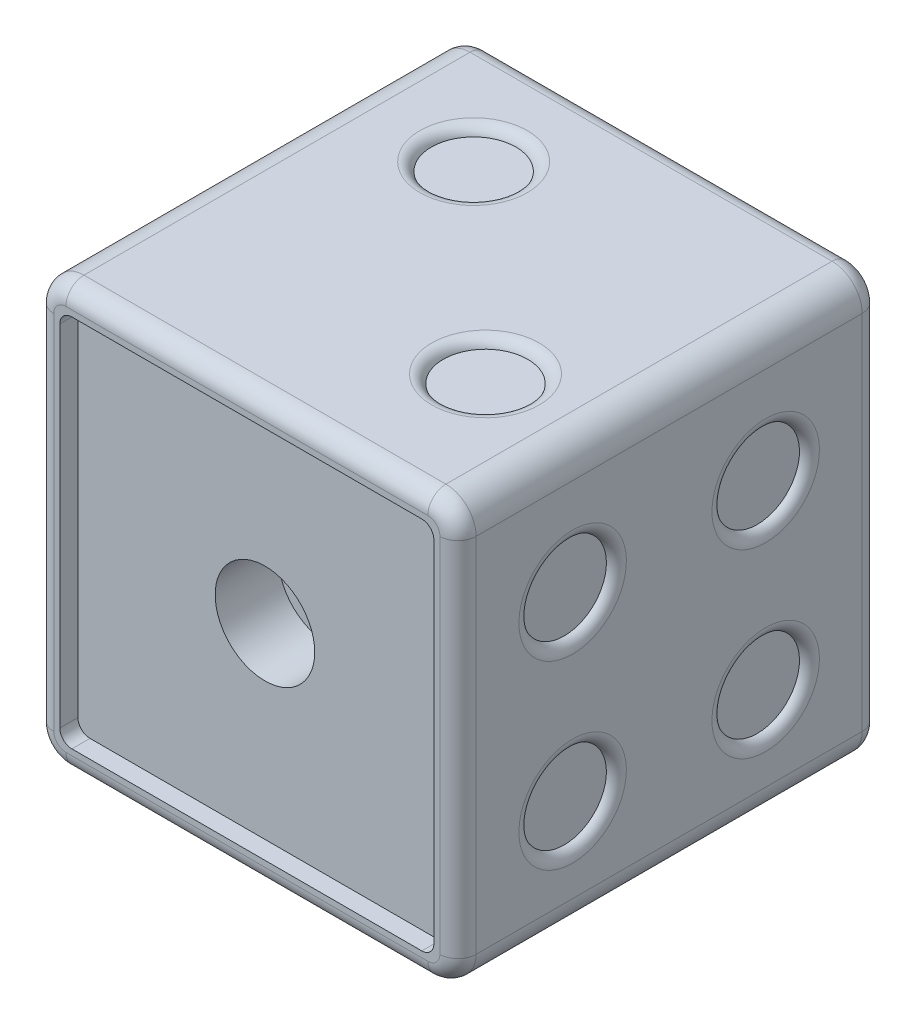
ISO-10303-21;
HEADER;
FILE_DESCRIPTION(('STEP AP214'),'2;1');
FILE_NAME('part.step','',(''),(''),'','','');
FILE_SCHEMA(('AUTOMOTIVE_DESIGN { 1 0 10303 214 1 1 1 1 }'));
ENDSEC;
DATA;
#1=APPLICATION_CONTEXT('core data for automotive mechanical design processes');
#2=APPLICATION_PROTOCOL_DEFINITION('international standard','automotive_design',2000,#1);
#3=PRODUCT_CONTEXT('',#1,'mechanical');
#4=PRODUCT('Part','Part','',(#3));
#5=PRODUCT_RELATED_PRODUCT_CATEGORY('part','',(#4));
#6=PRODUCT_DEFINITION_FORMATION('','',#4);
#7=PRODUCT_DEFINITION_CONTEXT('part definition',#1,'design');
#8=PRODUCT_DEFINITION('design','',#6,#7);
#9=PRODUCT_DEFINITION_SHAPE('','',#8);
#10=(LENGTH_UNIT() NAMED_UNIT(*) SI_UNIT(.MILLI.,.METRE.));
#11=(NAMED_UNIT(*) PLANE_ANGLE_UNIT() SI_UNIT($,.RADIAN.));
#12=(NAMED_UNIT(*) SI_UNIT($,.STERADIAN.) SOLID_ANGLE_UNIT());
#13=UNCERTAINTY_MEASURE_WITH_UNIT(LENGTH_MEASURE(1.E-05),#10,'distance_accuracy_value','');
#14=(GEOMETRIC_REPRESENTATION_CONTEXT(3) GLOBAL_UNCERTAINTY_ASSIGNED_CONTEXT((#13)) GLOBAL_UNIT_ASSIGNED_CONTEXT((#10,
#11,#12)) REPRESENTATION_CONTEXT('',''));
#15=CARTESIAN_POINT('',(0.,0.,0.));
#16=DIRECTION('',(0.,0.,1.));
#17=DIRECTION('',(1.,0.,0.));
#18=AXIS2_PLACEMENT_3D('',#15,#16,#17);
#19=CARTESIAN_POINT('',(-17.5,-17.5,35.));
#20=DIRECTION('',(1.,0.,0.));
#21=DIRECTION('',(0.,0.,-1.));
#22=AXIS2_PLACEMENT_3D('',#19,#20,#21);
#23=PLANE('',#22);
#24=CARTESIAN_POINT('',(-17.5,8.00000000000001,9.5));
#25=DIRECTION('',(1.,0.,0.));
#26=DIRECTION('',(0.,0.,-1.));
#27=AXIS2_PLACEMENT_3D('',#24,#25,#26);
#28=CIRCLE('',#27,4.45393920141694);
#29=CARTESIAN_POINT('',(-17.5,8.00000000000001,5.04606079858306));
#30=VERTEX_POINT('',#29);
#31=EDGE_CURVE('E435',#30,#30,#28,.T.);
#32=ORIENTED_EDGE('',*,*,#31,.T.);
#33=EDGE_LOOP('',(#32));
#34=FACE_BOUND('',#33,.T.);
#35=CARTESIAN_POINT('',(-17.5,0.,17.5));
#36=DIRECTION('',(1.,0.,0.));
#37=DIRECTION('',(0.,0.,-1.));
#38=AXIS2_PLACEMENT_3D('',#35,#36,#37);
#39=CIRCLE('',#38,4.45393920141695);
#40=CARTESIAN_POINT('',(-17.5,0.,13.0460607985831));
#41=VERTEX_POINT('',#40);
#42=EDGE_CURVE('E432',#41,#41,#39,.T.);
#43=ORIENTED_EDGE('',*,*,#42,.T.);
#44=EDGE_LOOP('',(#43));
#45=FACE_BOUND('',#44,.T.);
#46=CARTESIAN_POINT('',(-17.5,-8.49896049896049,24.9677754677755));
#47=DIRECTION('',(1.,0.,0.));
#48=DIRECTION('',(0.,0.,-1.));
#49=AXIS2_PLACEMENT_3D('',#46,#47,#48);
#50=CIRCLE('',#49,4.45393920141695);
#51=CARTESIAN_POINT('',(-17.5,-8.49896049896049,20.5138362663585));
#52=VERTEX_POINT('',#51);
#53=EDGE_CURVE('E429',#52,#52,#50,.T.);
#54=ORIENTED_EDGE('',*,*,#53,.T.);
#55=EDGE_LOOP('',(#54));
#56=FACE_BOUND('',#55,.T.);
#57=DIRECTION('',(0.,0.,-1.));
#58=VECTOR('',#57,1.);
#59=CARTESIAN_POINT('',(-17.5,-15.,35.));
#60=LINE('',#59,#58);
#61=CARTESIAN_POINT('',(-17.5,-15.,1.5));
#62=VERTEX_POINT('',#61);
#63=CARTESIAN_POINT('',(-17.5,-15.,33.5));
#64=VERTEX_POINT('',#63);
#65=EDGE_CURVE('E276',#62,#64,#60,.F.);
#66=ORIENTED_EDGE('',*,*,#65,.T.);
#67=DIRECTION('',(0.,-1.,0.));
#68=VECTOR('',#67,1.);
#69=CARTESIAN_POINT('',(-17.5,15.,33.5));
#70=LINE('',#69,#68);
#71=CARTESIAN_POINT('',(-17.5,15.,33.5));
#72=VERTEX_POINT('',#71);
#73=EDGE_CURVE('E325',#64,#72,#70,.F.);
#74=ORIENTED_EDGE('',*,*,#73,.T.);
#75=DIRECTION('',(0.,0.,-1.));
#76=VECTOR('',#75,1.);
#77=CARTESIAN_POINT('',(-17.5,15.,35.));
#78=LINE('',#77,#76);
#79=CARTESIAN_POINT('',(-17.5,15.,1.5));
#80=VERTEX_POINT('',#79);
#81=EDGE_CURVE('E279',#72,#80,#78,.T.);
#82=ORIENTED_EDGE('',*,*,#81,.T.);
#83=DIRECTION('',(0.,-1.,0.));
#84=VECTOR('',#83,1.);
#85=CARTESIAN_POINT('',(-17.5,-17.5,1.5));
#86=LINE('',#85,#84);
#87=EDGE_CURVE('E323',#80,#62,#86,.T.);
#88=ORIENTED_EDGE('',*,*,#87,.T.);
#89=EDGE_LOOP('',(#66,#74,#82,#88));
#90=FACE_BOUND('',#89,.T.);
#91=ADVANCED_FACE('F47',(#34,#45,#56,#90),#23,.F.);
#92=CARTESIAN_POINT('',(17.5,-17.5,35.));
#93=DIRECTION('',(0.,1.,0.));
#94=DIRECTION('',(-1.,0.,0.));
#95=AXIS2_PLACEMENT_3D('',#92,#93,#94);
#96=PLANE('',#95);
#97=CARTESIAN_POINT('',(0.,-17.5,17.5));
#98=DIRECTION('',(0.,1.,0.));
#99=DIRECTION('',(-1.,0.,0.));
#100=AXIS2_PLACEMENT_3D('',#97,#98,#99);
#101=CIRCLE('',#100,4.45393920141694);
#102=CARTESIAN_POINT('',(-4.45393920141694,-17.5,17.5));
#103=VERTEX_POINT('',#102);
#104=EDGE_CURVE('E438',#103,#103,#101,.T.);
#105=ORIENTED_EDGE('',*,*,#104,.T.);
#106=EDGE_LOOP('',(#105));
#107=FACE_BOUND('',#106,.T.);
#108=DIRECTION('',(0.,0.,-1.));
#109=VECTOR('',#108,1.);
#110=CARTESIAN_POINT('',(15.,-17.5,35.));
#111=LINE('',#110,#109);
#112=CARTESIAN_POINT('',(15.,-17.5,1.5));
#113=VERTEX_POINT('',#112);
#114=CARTESIAN_POINT('',(15.,-17.5,33.5));
#115=VERTEX_POINT('',#114);
#116=EDGE_CURVE('E297',#113,#115,#111,.F.);
#117=ORIENTED_EDGE('',*,*,#116,.T.);
#118=DIRECTION('',(1.,0.,0.));
#119=VECTOR('',#118,1.);
#120=CARTESIAN_POINT('',(-15.,-17.5,33.5));
#121=LINE('',#120,#119);
#122=CARTESIAN_POINT('',(-15.,-17.5,33.5));
#123=VERTEX_POINT('',#122);
#124=EDGE_CURVE('E364',#115,#123,#121,.F.);
#125=ORIENTED_EDGE('',*,*,#124,.T.);
#126=DIRECTION('',(0.,0.,-1.));
#127=VECTOR('',#126,1.);
#128=CARTESIAN_POINT('',(-15.,-17.5,35.));
#129=LINE('',#128,#127);
#130=CARTESIAN_POINT('',(-15.,-17.5,1.5));
#131=VERTEX_POINT('',#130);
#132=EDGE_CURVE('E294',#123,#131,#129,.T.);
#133=ORIENTED_EDGE('',*,*,#132,.T.);
#134=DIRECTION('',(1.,0.,0.));
#135=VECTOR('',#134,1.);
#136=CARTESIAN_POINT('',(17.5,-17.5,1.5));
#137=LINE('',#136,#135);
#138=EDGE_CURVE('E362',#131,#113,#137,.T.);
#139=ORIENTED_EDGE('',*,*,#138,.T.);
#140=EDGE_LOOP('',(#117,#125,#133,#139));
#141=FACE_BOUND('',#140,.T.);
#142=ADVANCED_FACE('F539',(#107,#141),#96,.F.);
#143=CARTESIAN_POINT('',(17.5,-17.5,35.));
#144=DIRECTION('',(-1.,0.,0.));
#145=DIRECTION('',(0.,-1.,0.));
#146=AXIS2_PLACEMENT_3D('',#143,#144,#145);
#147=PLANE('',#146);
#148=CARTESIAN_POINT('',(17.5,-8.,25.5));
#149=DIRECTION('',(-1.,0.,0.));
#150=DIRECTION('',(0.,-1.,0.));
#151=AXIS2_PLACEMENT_3D('',#148,#149,#150);
#152=CIRCLE('',#151,4.45393920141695);
#153=CARTESIAN_POINT('',(17.5,-12.4539392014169,25.5));
#154=VERTEX_POINT('',#153);
#155=EDGE_CURVE('E420',#154,#154,#152,.T.);
#156=ORIENTED_EDGE('',*,*,#155,.T.);
#157=EDGE_LOOP('',(#156));
#158=FACE_BOUND('',#157,.T.);
#159=CARTESIAN_POINT('',(17.5,-7.99999999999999,9.49999999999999));
#160=DIRECTION('',(-1.,0.,0.));
#161=DIRECTION('',(0.,-1.,0.));
#162=AXIS2_PLACEMENT_3D('',#159,#160,#161);
#163=CIRCLE('',#162,4.45393920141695);
#164=CARTESIAN_POINT('',(17.5,-12.4539392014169,9.49999999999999));
#165=VERTEX_POINT('',#164);
#166=EDGE_CURVE('E417',#165,#165,#163,.T.);
#167=ORIENTED_EDGE('',*,*,#166,.T.);
#168=EDGE_LOOP('',(#167));
#169=FACE_BOUND('',#168,.T.);
#170=CARTESIAN_POINT('',(17.5,7.00000000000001,9.5));
#171=DIRECTION('',(-1.,0.,0.));
#172=DIRECTION('',(0.,-1.,0.));
#173=AXIS2_PLACEMENT_3D('',#170,#171,#172);
#174=CIRCLE('',#173,4.45393920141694);
#175=CARTESIAN_POINT('',(17.5,2.54606079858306,9.5));
#176=VERTEX_POINT('',#175);
#177=EDGE_CURVE('E414',#176,#176,#174,.T.);
#178=ORIENTED_EDGE('',*,*,#177,.T.);
#179=EDGE_LOOP('',(#178));
#180=FACE_BOUND('',#179,.T.);
#181=CARTESIAN_POINT('',(17.5,7.,25.5));
#182=DIRECTION('',(-1.,0.,0.));
#183=DIRECTION('',(0.,-1.,0.));
#184=AXIS2_PLACEMENT_3D('',#181,#182,#183);
#185=CIRCLE('',#184,4.45393920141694);
#186=CARTESIAN_POINT('',(17.5,2.54606079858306,25.5));
#187=VERTEX_POINT('',#186);
#188=EDGE_CURVE('E366',#187,#187,#185,.T.);
#189=ORIENTED_EDGE('',*,*,#188,.T.);
#190=EDGE_LOOP('',(#189));
#191=FACE_BOUND('',#190,.T.);
#192=DIRECTION('',(0.,0.,-1.));
#193=VECTOR('',#192,1.);
#194=CARTESIAN_POINT('',(17.5,15.,35.));
#195=LINE('',#194,#193);
#196=CARTESIAN_POINT('',(17.5,15.,1.5));
#197=VERTEX_POINT('',#196);
#198=CARTESIAN_POINT('',(17.5,15.,33.5));
#199=VERTEX_POINT('',#198);
#200=EDGE_CURVE('E291',#197,#199,#195,.F.);
#201=ORIENTED_EDGE('',*,*,#200,.T.);
#202=DIRECTION('',(0.,1.,0.));
#203=VECTOR('',#202,1.);
#204=CARTESIAN_POINT('',(17.5,-15.,33.5));
#205=LINE('',#204,#203);
#206=CARTESIAN_POINT('',(17.5,-15.,33.5));
#207=VERTEX_POINT('',#206);
#208=EDGE_CURVE('E341',#199,#207,#205,.F.);
#209=ORIENTED_EDGE('',*,*,#208,.T.);
#210=DIRECTION('',(0.,0.,-1.));
#211=VECTOR('',#210,1.);
#212=CARTESIAN_POINT('',(17.5,-15.,35.));
#213=LINE('',#212,#211);
#214=CARTESIAN_POINT('',(17.5,-15.,1.5));
#215=VERTEX_POINT('',#214);
#216=EDGE_CURVE('E288',#207,#215,#213,.T.);
#217=ORIENTED_EDGE('',*,*,#216,.T.);
#218=DIRECTION('',(0.,1.,0.));
#219=VECTOR('',#218,1.);
#220=CARTESIAN_POINT('',(17.5,-17.5,1.5));
#221=LINE('',#220,#219);
#222=EDGE_CURVE('E339',#215,#197,#221,.T.);
#223=ORIENTED_EDGE('',*,*,#222,.T.);
#224=EDGE_LOOP('',(#201,#209,#217,#223));
#225=FACE_BOUND('',#224,.T.);
#226=ADVANCED_FACE('F546',(#158,#169,#180,#191,#225),#147,.F.);
#227=CARTESIAN_POINT('',(17.5,17.5,35.));
#228=DIRECTION('',(0.,-1.,0.));
#229=DIRECTION('',(1.,0.,0.));
#230=AXIS2_PLACEMENT_3D('',#227,#228,#229);
#231=PLANE('',#230);
#232=CARTESIAN_POINT('',(8.72993536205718,17.5,23.9507750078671));
#233=DIRECTION('',(0.,-1.,0.));
#234=DIRECTION('',(1.,0.,0.));
#235=AXIS2_PLACEMENT_3D('',#232,#233,#234);
#236=CIRCLE('',#235,4.45393920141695);
#237=CARTESIAN_POINT('',(13.1838745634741,17.5,23.9507750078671));
#238=VERTEX_POINT('',#237);
#239=EDGE_CURVE('E426',#238,#238,#236,.T.);
#240=ORIENTED_EDGE('',*,*,#239,.T.);
#241=EDGE_LOOP('',(#240));
#242=FACE_BOUND('',#241,.T.);
#243=CARTESIAN_POINT('',(-7.,17.5,9.20396060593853));
#244=DIRECTION('',(0.,-1.,0.));
#245=DIRECTION('',(1.,0.,0.));
#246=AXIS2_PLACEMENT_3D('',#243,#244,#245);
#247=CIRCLE('',#246,4.45393920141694);
#248=CARTESIAN_POINT('',(-2.54606079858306,17.5,9.20396060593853));
#249=VERTEX_POINT('',#248);
#250=EDGE_CURVE('E423',#249,#249,#247,.T.);
#251=ORIENTED_EDGE('',*,*,#250,.T.);
#252=EDGE_LOOP('',(#251));
#253=FACE_BOUND('',#252,.T.);
#254=DIRECTION('',(0.,0.,-1.));
#255=VECTOR('',#254,1.);
#256=CARTESIAN_POINT('',(-15.,17.5,35.));
#257=LINE('',#256,#255);
#258=CARTESIAN_POINT('',(-15.,17.5,1.5));
#259=VERTEX_POINT('',#258);
#260=CARTESIAN_POINT('',(-15.,17.5,33.5));
#261=VERTEX_POINT('',#260);
#262=EDGE_CURVE('E285',#259,#261,#257,.F.);
#263=ORIENTED_EDGE('',*,*,#262,.T.);
#264=DIRECTION('',(-1.,0.,0.));
#265=VECTOR('',#264,1.);
#266=CARTESIAN_POINT('',(15.,17.5,33.5));
#267=LINE('',#266,#265);
#268=CARTESIAN_POINT('',(15.,17.5,33.5));
#269=VERTEX_POINT('',#268);
#270=EDGE_CURVE('E333',#261,#269,#267,.F.);
#271=ORIENTED_EDGE('',*,*,#270,.T.);
#272=DIRECTION('',(0.,0.,-1.));
#273=VECTOR('',#272,1.);
#274=CARTESIAN_POINT('',(15.,17.5,35.));
#275=LINE('',#274,#273);
#276=CARTESIAN_POINT('',(15.,17.5,1.5));
#277=VERTEX_POINT('',#276);
#278=EDGE_CURVE('E282',#269,#277,#275,.T.);
#279=ORIENTED_EDGE('',*,*,#278,.T.);
#280=DIRECTION('',(-1.,0.,0.));
#281=VECTOR('',#280,1.);
#282=CARTESIAN_POINT('',(17.5,17.5,1.5));
#283=LINE('',#282,#281);
#284=EDGE_CURVE('E331',#277,#259,#283,.T.);
#285=ORIENTED_EDGE('',*,*,#284,.T.);
#286=EDGE_LOOP('',(#263,#271,#279,#285));
#287=FACE_BOUND('',#286,.T.);
#288=ADVANCED_FACE('F553',(#242,#253,#287),#231,.F.);
#289=CARTESIAN_POINT('',(0.,0.,35.));
#290=DIRECTION('',(0.,0.,1.));
#291=DIRECTION('',(1.,0.,0.));
#292=AXIS2_PLACEMENT_3D('',#289,#290,#291);
#293=PLANE('',#292);
#294=DIRECTION('',(0.,-1.,0.));
#295=VECTOR('',#294,1.);
#296=CARTESIAN_POINT('',(-16.,-15.,35.));
#297=LINE('',#296,#295);
#298=CARTESIAN_POINT('',(-16.,15.,35.));
#299=VERTEX_POINT('',#298);
#300=CARTESIAN_POINT('',(-16.,-15.,35.));
#301=VERTEX_POINT('',#300);
#302=EDGE_CURVE('E312',#299,#301,#297,.T.);
#303=ORIENTED_EDGE('',*,*,#302,.T.);
#304=CARTESIAN_POINT('',(-15.,-15.,35.));
#305=DIRECTION('',(0.,0.,1.));
#306=DIRECTION('',(1.,0.,0.));
#307=AXIS2_PLACEMENT_3D('',#304,#305,#306);
#308=CIRCLE('',#307,1.);
#309=CARTESIAN_POINT('',(-15.,-16.,35.));
#310=VERTEX_POINT('',#309);
#311=EDGE_CURVE('E314',#301,#310,#308,.T.);
#312=ORIENTED_EDGE('',*,*,#311,.T.);
#313=DIRECTION('',(1.,0.,0.));
#314=VECTOR('',#313,1.);
#315=CARTESIAN_POINT('',(15.,-16.,35.));
#316=LINE('',#315,#314);
#317=CARTESIAN_POINT('',(15.,-16.,35.));
#318=VERTEX_POINT('',#317);
#319=EDGE_CURVE('E300',#310,#318,#316,.T.);
#320=ORIENTED_EDGE('',*,*,#319,.T.);
#321=CARTESIAN_POINT('',(15.,-15.,35.));
#322=DIRECTION('',(0.,0.,1.));
#323=DIRECTION('',(1.,0.,0.));
#324=AXIS2_PLACEMENT_3D('',#321,#322,#323);
#325=CIRCLE('',#324,1.);
#326=CARTESIAN_POINT('',(16.,-15.,35.));
#327=VERTEX_POINT('',#326);
#328=EDGE_CURVE('E302',#318,#327,#325,.T.);
#329=ORIENTED_EDGE('',*,*,#328,.T.);
#330=DIRECTION('',(0.,1.,0.));
#331=VECTOR('',#330,1.);
#332=CARTESIAN_POINT('',(16.,15.,35.));
#333=LINE('',#332,#331);
#334=CARTESIAN_POINT('',(16.,15.,35.));
#335=VERTEX_POINT('',#334);
#336=EDGE_CURVE('E304',#327,#335,#333,.T.);
#337=ORIENTED_EDGE('',*,*,#336,.T.);
#338=CARTESIAN_POINT('',(15.,15.,35.));
#339=DIRECTION('',(0.,0.,1.));
#340=DIRECTION('',(1.,0.,0.));
#341=AXIS2_PLACEMENT_3D('',#338,#339,#340);
#342=CIRCLE('',#341,1.);
#343=CARTESIAN_POINT('',(15.,16.,35.));
#344=VERTEX_POINT('',#343);
#345=EDGE_CURVE('E306',#335,#344,#342,.T.);
#346=ORIENTED_EDGE('',*,*,#345,.T.);
#347=DIRECTION('',(-1.,0.,0.));
#348=VECTOR('',#347,1.);
#349=CARTESIAN_POINT('',(-15.,16.,35.));
#350=LINE('',#349,#348);
#351=CARTESIAN_POINT('',(-15.,16.,35.));
#352=VERTEX_POINT('',#351);
#353=EDGE_CURVE('E308',#344,#352,#350,.T.);
#354=ORIENTED_EDGE('',*,*,#353,.T.);
#355=CARTESIAN_POINT('',(-15.,15.,35.));
#356=DIRECTION('',(0.,0.,1.));
#357=DIRECTION('',(1.,0.,0.));
#358=AXIS2_PLACEMENT_3D('',#355,#356,#357);
#359=CIRCLE('',#358,1.);
#360=EDGE_CURVE('E310',#352,#299,#359,.T.);
#361=ORIENTED_EDGE('',*,*,#360,.T.);
#362=EDGE_LOOP('',(#303,#312,#320,#329,#337,#346,#354,#361));
#363=FACE_BOUND('',#362,.T.);
#364=DIRECTION('',(0.,-1.,0.));
#365=VECTOR('',#364,1.);
#366=CARTESIAN_POINT('',(-15.5,-15.5,35.));
#367=LINE('',#366,#365);
#368=CARTESIAN_POINT('',(-15.5,14.5,35.));
#369=VERTEX_POINT('',#368);
#370=CARTESIAN_POINT('',(-15.5,-14.5,35.));
#371=VERTEX_POINT('',#370);
#372=EDGE_CURVE('E237',#369,#371,#367,.T.);
#373=ORIENTED_EDGE('',*,*,#372,.F.);
#374=CARTESIAN_POINT('',(-14.5,14.5,35.));
#375=DIRECTION('',(0.,0.,1.));
#376=DIRECTION('',(1.,0.,0.));
#377=AXIS2_PLACEMENT_3D('',#374,#375,#376);
#378=CIRCLE('',#377,1.);
#379=CARTESIAN_POINT('',(-14.5,15.5,35.));
#380=VERTEX_POINT('',#379);
#381=EDGE_CURVE('E274',#369,#380,#378,.F.);
#382=ORIENTED_EDGE('',*,*,#381,.T.);
#383=DIRECTION('',(-1.,0.,0.));
#384=VECTOR('',#383,1.);
#385=CARTESIAN_POINT('',(15.5,15.5,35.));
#386=LINE('',#385,#384);
#387=CARTESIAN_POINT('',(14.5,15.5,35.));
#388=VERTEX_POINT('',#387);
#389=EDGE_CURVE('E240',#388,#380,#386,.T.);
#390=ORIENTED_EDGE('',*,*,#389,.F.);
#391=CARTESIAN_POINT('',(14.5,14.5,35.));
#392=DIRECTION('',(0.,0.,1.));
#393=DIRECTION('',(1.,0.,0.));
#394=AXIS2_PLACEMENT_3D('',#391,#392,#393);
#395=CIRCLE('',#394,1.);
#396=CARTESIAN_POINT('',(15.5,14.5,35.));
#397=VERTEX_POINT('',#396);
#398=EDGE_CURVE('E272',#388,#397,#395,.F.);
#399=ORIENTED_EDGE('',*,*,#398,.T.);
#400=DIRECTION('',(0.,1.,0.));
#401=VECTOR('',#400,1.);
#402=CARTESIAN_POINT('',(15.5,-15.5,35.));
#403=LINE('',#402,#401);
#404=CARTESIAN_POINT('',(15.5,-14.5,35.));
#405=VERTEX_POINT('',#404);
#406=EDGE_CURVE('E236',#405,#397,#403,.T.);
#407=ORIENTED_EDGE('',*,*,#406,.F.);
#408=CARTESIAN_POINT('',(14.5,-14.5,35.));
#409=DIRECTION('',(0.,0.,1.));
#410=DIRECTION('',(1.,0.,0.));
#411=AXIS2_PLACEMENT_3D('',#408,#409,#410);
#412=CIRCLE('',#411,1.);
#413=CARTESIAN_POINT('',(14.5,-15.5,35.));
#414=VERTEX_POINT('',#413);
#415=EDGE_CURVE('E220',#405,#414,#412,.F.);
#416=ORIENTED_EDGE('',*,*,#415,.T.);
#417=DIRECTION('',(1.,0.,0.));
#418=VECTOR('',#417,1.);
#419=CARTESIAN_POINT('',(15.5,-15.5,35.));
#420=LINE('',#419,#418);
#421=CARTESIAN_POINT('',(-14.5,-15.5,35.));
#422=VERTEX_POINT('',#421);
#423=EDGE_CURVE('E227',#422,#414,#420,.T.);
#424=ORIENTED_EDGE('',*,*,#423,.F.);
#425=CARTESIAN_POINT('',(-14.5,-14.5,35.));
#426=DIRECTION('',(0.,0.,1.));
#427=DIRECTION('',(1.,0.,0.));
#428=AXIS2_PLACEMENT_3D('',#425,#426,#427);
#429=CIRCLE('',#428,1.);
#430=EDGE_CURVE('E210',#422,#371,#429,.F.);
#431=ORIENTED_EDGE('',*,*,#430,.T.);
#432=EDGE_LOOP('',(#373,#382,#390,#399,#407,#416,#424,#431));
#433=FACE_BOUND('',#432,.T.);
#434=ADVANCED_FACE('F234',(#363,#433),#293,.T.);
#435=CARTESIAN_POINT('',(0.,0.,0.));
#436=DIRECTION('',(0.,0.,1.));
#437=DIRECTION('',(1.,0.,0.));
#438=AXIS2_PLACEMENT_3D('',#435,#436,#437);
#439=PLANE('',#438);
#440=CARTESIAN_POINT('',(-8.00000000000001,-9.,0.));
#441=DIRECTION('',(0.,0.,1.));
#442=DIRECTION('',(1.,0.,0.));
#443=AXIS2_PLACEMENT_3D('',#440,#441,#442);
#444=CIRCLE('',#443,4.45393920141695);
#445=CARTESIAN_POINT('',(-3.54606079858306,-9.,0.));
#446=VERTEX_POINT('',#445);
#447=EDGE_CURVE('E11',#446,#446,#444,.T.);
#448=ORIENTED_EDGE('',*,*,#447,.T.);
#449=EDGE_LOOP('',(#448));
#450=FACE_BOUND('',#449,.T.);
#451=CARTESIAN_POINT('',(-8.00000000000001,9.00000000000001,0.));
#452=DIRECTION('',(0.,0.,1.));
#453=DIRECTION('',(1.,0.,0.));
#454=AXIS2_PLACEMENT_3D('',#451,#452,#453);
#455=CIRCLE('',#454,4.45393920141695);
#456=CARTESIAN_POINT('',(-3.54606079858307,9.00000000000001,0.));
#457=VERTEX_POINT('',#456);
#458=EDGE_CURVE('E55',#457,#457,#455,.T.);
#459=ORIENTED_EDGE('',*,*,#458,.T.);
#460=EDGE_LOOP('',(#459));
#461=FACE_BOUND('',#460,.T.);
#462=CARTESIAN_POINT('',(0.,0.,0.));
#463=DIRECTION('',(0.,0.,1.));
#464=DIRECTION('',(1.,0.,0.));
#465=AXIS2_PLACEMENT_3D('',#462,#463,#464);
#466=CIRCLE('',#465,4.45393920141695);
#467=CARTESIAN_POINT('',(4.45393920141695,0.,0.));
#468=VERTEX_POINT('',#467);
#469=EDGE_CURVE('E447',#468,#468,#466,.T.);
#470=ORIENTED_EDGE('',*,*,#469,.T.);
#471=EDGE_LOOP('',(#470));
#472=FACE_BOUND('',#471,.T.);
#473=CARTESIAN_POINT('',(8.00000000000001,9.00000000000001,0.));
#474=DIRECTION('',(0.,0.,1.));
#475=DIRECTION('',(1.,0.,0.));
#476=AXIS2_PLACEMENT_3D('',#473,#474,#475);
#477=CIRCLE('',#476,4.45393920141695);
#478=CARTESIAN_POINT('',(12.453939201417,9.00000000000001,0.));
#479=VERTEX_POINT('',#478);
#480=EDGE_CURVE('E444',#479,#479,#477,.T.);
#481=ORIENTED_EDGE('',*,*,#480,.T.);
#482=EDGE_LOOP('',(#481));
#483=FACE_BOUND('',#482,.T.);
#484=CARTESIAN_POINT('',(8.00000000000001,-9.,0.));
#485=DIRECTION('',(0.,0.,1.));
#486=DIRECTION('',(1.,0.,0.));
#487=AXIS2_PLACEMENT_3D('',#484,#485,#486);
#488=CIRCLE('',#487,4.45393920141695);
#489=CARTESIAN_POINT('',(12.453939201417,-9.,0.));
#490=VERTEX_POINT('',#489);
#491=EDGE_CURVE('E441',#490,#490,#488,.T.);
#492=ORIENTED_EDGE('',*,*,#491,.T.);
#493=EDGE_LOOP('',(#492));
#494=FACE_BOUND('',#493,.T.);
#495=DIRECTION('',(1.,0.,0.));
#496=VECTOR('',#495,1.);
#497=CARTESIAN_POINT('',(0.,-16.,0.));
#498=LINE('',#497,#496);
#499=CARTESIAN_POINT('',(15.,-16.,0.));
#500=VERTEX_POINT('',#499);
#501=CARTESIAN_POINT('',(-15.,-16.,0.));
#502=VERTEX_POINT('',#501);
#503=EDGE_CURVE('E347',#500,#502,#498,.F.);
#504=ORIENTED_EDGE('',*,*,#503,.T.);
#505=CARTESIAN_POINT('',(-15.,-15.,0.));
#506=DIRECTION('',(0.,0.,1.));
#507=DIRECTION('',(1.,0.,0.));
#508=AXIS2_PLACEMENT_3D('',#505,#506,#507);
#509=CIRCLE('',#508,1.);
#510=CARTESIAN_POINT('',(-16.,-15.,0.));
#511=VERTEX_POINT('',#510);
#512=EDGE_CURVE('E360',#502,#511,#509,.F.);
#513=ORIENTED_EDGE('',*,*,#512,.T.);
#514=DIRECTION('',(0.,-1.,0.));
#515=VECTOR('',#514,1.);
#516=CARTESIAN_POINT('',(-16.,0.,0.));
#517=LINE('',#516,#515);
#518=CARTESIAN_POINT('',(-16.,15.,0.));
#519=VERTEX_POINT('',#518);
#520=EDGE_CURVE('E69',#511,#519,#517,.F.);
#521=ORIENTED_EDGE('',*,*,#520,.T.);
#522=CARTESIAN_POINT('',(-15.,15.,0.));
#523=DIRECTION('',(0.,0.,1.));
#524=DIRECTION('',(1.,0.,0.));
#525=AXIS2_PLACEMENT_3D('',#522,#523,#524);
#526=CIRCLE('',#525,1.);
#527=CARTESIAN_POINT('',(-15.,16.,0.));
#528=VERTEX_POINT('',#527);
#529=EDGE_CURVE('E357',#519,#528,#526,.F.);
#530=ORIENTED_EDGE('',*,*,#529,.T.);
#531=DIRECTION('',(-1.,0.,0.));
#532=VECTOR('',#531,1.);
#533=CARTESIAN_POINT('',(0.,16.,0.));
#534=LINE('',#533,#532);
#535=CARTESIAN_POINT('',(15.,16.,0.));
#536=VERTEX_POINT('',#535);
#537=EDGE_CURVE('E355',#528,#536,#534,.F.);
#538=ORIENTED_EDGE('',*,*,#537,.T.);
#539=CARTESIAN_POINT('',(15.,15.,0.));
#540=DIRECTION('',(0.,0.,1.));
#541=DIRECTION('',(1.,0.,0.));
#542=AXIS2_PLACEMENT_3D('',#539,#540,#541);
#543=CIRCLE('',#542,1.);
#544=CARTESIAN_POINT('',(16.,15.,0.));
#545=VERTEX_POINT('',#544);
#546=EDGE_CURVE('E353',#536,#545,#543,.F.);
#547=ORIENTED_EDGE('',*,*,#546,.T.);
#548=DIRECTION('',(0.,1.,0.));
#549=VECTOR('',#548,1.);
#550=CARTESIAN_POINT('',(16.,0.,0.));
#551=LINE('',#550,#549);
#552=CARTESIAN_POINT('',(16.,-15.,0.));
#553=VERTEX_POINT('',#552);
#554=EDGE_CURVE('E351',#545,#553,#551,.F.);
#555=ORIENTED_EDGE('',*,*,#554,.T.);
#556=CARTESIAN_POINT('',(15.,-15.,0.));
#557=DIRECTION('',(0.,0.,1.));
#558=DIRECTION('',(1.,0.,0.));
#559=AXIS2_PLACEMENT_3D('',#556,#557,#558);
#560=CIRCLE('',#559,1.);
#561=EDGE_CURVE('E349',#553,#500,#560,.F.);
#562=ORIENTED_EDGE('',*,*,#561,.T.);
#563=EDGE_LOOP('',(#504,#513,#521,#530,#538,#547,#555,#562));
#564=FACE_BOUND('',#563,.T.);
#565=ADVANCED_FACE('F452',(#450,#461,#472,#483,#494,#564),#439,.F.);
#566=CARTESIAN_POINT('',(-15.5,-15.5,33.5));
#567=DIRECTION('',(-1.,0.,0.));
#568=DIRECTION('',(0.,0.,1.));
#569=AXIS2_PLACEMENT_3D('',#566,#567,#568);
#570=PLANE('',#569);
#571=ORIENTED_EDGE('',*,*,#372,.T.);
#572=DIRECTION('',(0.,0.,1.));
#573=VECTOR('',#572,1.);
#574=CARTESIAN_POINT('',(-15.5,-14.5,33.5));
#575=LINE('',#574,#573);
#576=CARTESIAN_POINT('',(-15.5,-14.5,33.5));
#577=VERTEX_POINT('',#576);
#578=EDGE_CURVE('E215',#371,#577,#575,.F.);
#579=ORIENTED_EDGE('',*,*,#578,.T.);
#580=DIRECTION('',(0.,-1.,0.));
#581=VECTOR('',#580,1.);
#582=CARTESIAN_POINT('',(-15.5,-15.5,33.5));
#583=LINE('',#582,#581);
#584=CARTESIAN_POINT('',(-15.5,14.5,33.5));
#585=VERTEX_POINT('',#584);
#586=EDGE_CURVE('E248',#585,#577,#583,.T.);
#587=ORIENTED_EDGE('',*,*,#586,.F.);
#588=DIRECTION('',(0.,0.,1.));
#589=VECTOR('',#588,1.);
#590=CARTESIAN_POINT('',(-15.5,14.5,35.));
#591=LINE('',#590,#589);
#592=EDGE_CURVE('E231',#585,#369,#591,.T.);
#593=ORIENTED_EDGE('',*,*,#592,.T.);
#594=EDGE_LOOP('',(#571,#579,#587,#593));
#595=FACE_BOUND('',#594,.T.);
#596=ADVANCED_FACE('F517',(#595),#570,.F.);
#597=CARTESIAN_POINT('',(15.5,15.5,33.5));
#598=DIRECTION('',(0.,1.,0.));
#599=DIRECTION('',(-1.,0.,0.));
#600=AXIS2_PLACEMENT_3D('',#597,#598,#599);
#601=PLANE('',#600);
#602=DIRECTION('',(-1.,0.,0.));
#603=VECTOR('',#602,1.);
#604=CARTESIAN_POINT('',(15.5,15.5,33.5));
#605=LINE('',#604,#603);
#606=CARTESIAN_POINT('',(14.5,15.5,33.5));
#607=VERTEX_POINT('',#606);
#608=CARTESIAN_POINT('',(-14.5,15.5,33.5));
#609=VERTEX_POINT('',#608);
#610=EDGE_CURVE('E249',#607,#609,#605,.T.);
#611=ORIENTED_EDGE('',*,*,#610,.F.);
#612=DIRECTION('',(0.,0.,1.));
#613=VECTOR('',#612,1.);
#614=CARTESIAN_POINT('',(14.5,15.5,35.));
#615=LINE('',#614,#613);
#616=EDGE_CURVE('E221',#607,#388,#615,.T.);
#617=ORIENTED_EDGE('',*,*,#616,.T.);
#618=ORIENTED_EDGE('',*,*,#389,.T.);
#619=DIRECTION('',(0.,0.,1.));
#620=VECTOR('',#619,1.);
#621=CARTESIAN_POINT('',(-14.5,15.5,33.5));
#622=LINE('',#621,#620);
#623=EDGE_CURVE('E267',#380,#609,#622,.F.);
#624=ORIENTED_EDGE('',*,*,#623,.T.);
#625=EDGE_LOOP('',(#611,#617,#618,#624));
#626=FACE_BOUND('',#625,.T.);
#627=ADVANCED_FACE('F519',(#626),#601,.F.);
#628=CARTESIAN_POINT('',(15.5,-15.5,33.5));
#629=DIRECTION('',(1.,0.,0.));
#630=DIRECTION('',(0.,0.,-1.));
#631=AXIS2_PLACEMENT_3D('',#628,#629,#630);
#632=PLANE('',#631);
#633=DIRECTION('',(0.,1.,0.));
#634=VECTOR('',#633,1.);
#635=CARTESIAN_POINT('',(15.5,-15.5,33.5));
#636=LINE('',#635,#634);
#637=CARTESIAN_POINT('',(15.5,-14.5,33.5));
#638=VERTEX_POINT('',#637);
#639=CARTESIAN_POINT('',(15.5,14.5,33.5));
#640=VERTEX_POINT('',#639);
#641=EDGE_CURVE('E501',#638,#640,#636,.T.);
#642=ORIENTED_EDGE('',*,*,#641,.F.);
#643=DIRECTION('',(0.,0.,1.));
#644=VECTOR('',#643,1.);
#645=CARTESIAN_POINT('',(15.5,-14.5,35.));
#646=LINE('',#645,#644);
#647=EDGE_CURVE('E264',#638,#405,#646,.T.);
#648=ORIENTED_EDGE('',*,*,#647,.T.);
#649=ORIENTED_EDGE('',*,*,#406,.T.);
#650=DIRECTION('',(0.,0.,1.));
#651=VECTOR('',#650,1.);
#652=CARTESIAN_POINT('',(15.5,14.5,33.5));
#653=LINE('',#652,#651);
#654=EDGE_CURVE('E262',#397,#640,#653,.F.);
#655=ORIENTED_EDGE('',*,*,#654,.T.);
#656=EDGE_LOOP('',(#642,#648,#649,#655));
#657=FACE_BOUND('',#656,.T.);
#658=ADVANCED_FACE('F525',(#657),#632,.F.);
#659=CARTESIAN_POINT('',(15.5,-15.5,33.5));
#660=DIRECTION('',(0.,-1.,0.));
#661=DIRECTION('',(1.,0.,0.));
#662=AXIS2_PLACEMENT_3D('',#659,#660,#661);
#663=PLANE('',#662);
#664=DIRECTION('',(1.,0.,0.));
#665=VECTOR('',#664,1.);
#666=CARTESIAN_POINT('',(15.5,-15.5,33.5));
#667=LINE('',#666,#665);
#668=CARTESIAN_POINT('',(-14.5,-15.5,33.5));
#669=VERTEX_POINT('',#668);
#670=CARTESIAN_POINT('',(14.5,-15.5,33.5));
#671=VERTEX_POINT('',#670);
#672=EDGE_CURVE('E230',#669,#671,#667,.T.);
#673=ORIENTED_EDGE('',*,*,#672,.F.);
#674=DIRECTION('',(0.,0.,1.));
#675=VECTOR('',#674,1.);
#676=CARTESIAN_POINT('',(-14.5,-15.5,35.));
#677=LINE('',#676,#675);
#678=EDGE_CURVE('E214',#669,#422,#677,.T.);
#679=ORIENTED_EDGE('',*,*,#678,.T.);
#680=ORIENTED_EDGE('',*,*,#423,.T.);
#681=DIRECTION('',(0.,0.,1.));
#682=VECTOR('',#681,1.);
#683=CARTESIAN_POINT('',(14.5,-15.5,33.5));
#684=LINE('',#683,#682);
#685=EDGE_CURVE('E232',#414,#671,#684,.F.);
#686=ORIENTED_EDGE('',*,*,#685,.T.);
#687=EDGE_LOOP('',(#673,#679,#680,#686));
#688=FACE_BOUND('',#687,.T.);
#689=ADVANCED_FACE('F226',(#688),#663,.F.);
#690=CARTESIAN_POINT('',(0.,0.,33.5));
#691=DIRECTION('',(0.,0.,1.));
#692=DIRECTION('',(1.,0.,0.));
#693=AXIS2_PLACEMENT_3D('',#690,#691,#692);
#694=PLANE('',#693);
#695=CARTESIAN_POINT('',(0.,0.,33.5));
#696=DIRECTION('',(0.,0.,1.));
#697=DIRECTION('',(1.,0.,0.));
#698=AXIS2_PLACEMENT_3D('',#695,#696,#697);
#699=CIRCLE('',#698,4.125);
#700=CARTESIAN_POINT('',(4.125,0.,33.5));
#701=VERTEX_POINT('',#700);
#702=EDGE_CURVE('E390',#701,#701,#699,.T.);
#703=ORIENTED_EDGE('',*,*,#702,.F.);
#704=EDGE_LOOP('',(#703));
#705=FACE_BOUND('',#704,.T.);
#706=ORIENTED_EDGE('',*,*,#586,.T.);
#707=CARTESIAN_POINT('',(-14.5,-14.5,33.5));
#708=DIRECTION('',(0.,0.,1.));
#709=DIRECTION('',(1.,0.,0.));
#710=AXIS2_PLACEMENT_3D('',#707,#708,#709);
#711=CIRCLE('',#710,1.);
#712=EDGE_CURVE('E260',#577,#669,#711,.T.);
#713=ORIENTED_EDGE('',*,*,#712,.T.);
#714=ORIENTED_EDGE('',*,*,#672,.T.);
#715=CARTESIAN_POINT('',(14.5,-14.5,33.5));
#716=DIRECTION('',(0.,0.,1.));
#717=DIRECTION('',(1.,0.,0.));
#718=AXIS2_PLACEMENT_3D('',#715,#716,#717);
#719=CIRCLE('',#718,1.);
#720=EDGE_CURVE('E258',#671,#638,#719,.T.);
#721=ORIENTED_EDGE('',*,*,#720,.T.);
#722=ORIENTED_EDGE('',*,*,#641,.T.);
#723=CARTESIAN_POINT('',(14.5,14.5,33.5));
#724=DIRECTION('',(0.,0.,1.));
#725=DIRECTION('',(1.,0.,0.));
#726=AXIS2_PLACEMENT_3D('',#723,#724,#725);
#727=CIRCLE('',#726,1.);
#728=EDGE_CURVE('E256',#640,#607,#727,.T.);
#729=ORIENTED_EDGE('',*,*,#728,.T.);
#730=ORIENTED_EDGE('',*,*,#610,.T.);
#731=CARTESIAN_POINT('',(-14.5,14.5,33.5));
#732=DIRECTION('',(0.,0.,1.));
#733=DIRECTION('',(1.,0.,0.));
#734=AXIS2_PLACEMENT_3D('',#731,#732,#733);
#735=CIRCLE('',#734,1.);
#736=EDGE_CURVE('E254',#609,#585,#735,.T.);
#737=ORIENTED_EDGE('',*,*,#736,.T.);
#738=EDGE_LOOP('',(#706,#713,#714,#721,#722,#729,#730,#737));
#739=FACE_BOUND('',#738,.T.);
#740=ADVANCED_FACE('F507',(#705,#739),#694,.T.);
#741=CARTESIAN_POINT('',(-14.5,-14.5,33.5));
#742=DIRECTION('',(0.,0.,-1.));
#743=DIRECTION('',(-1.,0.,0.));
#744=AXIS2_PLACEMENT_3D('',#741,#742,#743);
#745=CYLINDRICAL_SURFACE('',#744,1.);
#746=ORIENTED_EDGE('',*,*,#712,.F.);
#747=ORIENTED_EDGE('',*,*,#578,.F.);
#748=ORIENTED_EDGE('',*,*,#430,.F.);
#749=ORIENTED_EDGE('',*,*,#678,.F.);
#750=EDGE_LOOP('',(#746,#747,#748,#749));
#751=FACE_BOUND('',#750,.T.);
#752=ADVANCED_FACE('F213',(#751),#745,.F.);
#753=CARTESIAN_POINT('',(14.5,-14.5,33.5));
#754=DIRECTION('',(0.,0.,-1.));
#755=DIRECTION('',(-1.,0.,0.));
#756=AXIS2_PLACEMENT_3D('',#753,#754,#755);
#757=CYLINDRICAL_SURFACE('',#756,1.);
#758=ORIENTED_EDGE('',*,*,#720,.F.);
#759=ORIENTED_EDGE('',*,*,#685,.F.);
#760=ORIENTED_EDGE('',*,*,#415,.F.);
#761=ORIENTED_EDGE('',*,*,#647,.F.);
#762=EDGE_LOOP('',(#758,#759,#760,#761));
#763=FACE_BOUND('',#762,.T.);
#764=ADVANCED_FACE('F529',(#763),#757,.F.);
#765=CARTESIAN_POINT('',(14.5,14.5,33.5));
#766=DIRECTION('',(0.,0.,-1.));
#767=DIRECTION('',(-1.,0.,0.));
#768=AXIS2_PLACEMENT_3D('',#765,#766,#767);
#769=CYLINDRICAL_SURFACE('',#768,1.);
#770=ORIENTED_EDGE('',*,*,#728,.F.);
#771=ORIENTED_EDGE('',*,*,#654,.F.);
#772=ORIENTED_EDGE('',*,*,#398,.F.);
#773=ORIENTED_EDGE('',*,*,#616,.F.);
#774=EDGE_LOOP('',(#770,#771,#772,#773));
#775=FACE_BOUND('',#774,.T.);
#776=ADVANCED_FACE('F521',(#775),#769,.F.);
#777=CARTESIAN_POINT('',(-14.5,14.5,33.5));
#778=DIRECTION('',(0.,0.,-1.));
#779=DIRECTION('',(-1.,0.,0.));
#780=AXIS2_PLACEMENT_3D('',#777,#778,#779);
#781=CYLINDRICAL_SURFACE('',#780,1.);
#782=ORIENTED_EDGE('',*,*,#736,.F.);
#783=ORIENTED_EDGE('',*,*,#623,.F.);
#784=ORIENTED_EDGE('',*,*,#381,.F.);
#785=ORIENTED_EDGE('',*,*,#592,.F.);
#786=EDGE_LOOP('',(#782,#783,#784,#785));
#787=FACE_BOUND('',#786,.T.);
#788=ADVANCED_FACE('F515',(#787),#781,.F.);
#789=CARTESIAN_POINT('',(0.,0.,28.25));
#790=DIRECTION('',(0.,0.,1.));
#791=DIRECTION('',(1.,0.,0.));
#792=AXIS2_PLACEMENT_3D('',#789,#790,#791);
#793=CYLINDRICAL_SURFACE('',#792,4.125);
#794=CARTESIAN_POINT('',(0.,0.,28.25));
#795=DIRECTION('',(0.,0.,1.));
#796=DIRECTION('',(1.,0.,0.));
#797=AXIS2_PLACEMENT_3D('',#794,#795,#796);
#798=CIRCLE('',#797,4.125);
#799=CARTESIAN_POINT('',(4.125,0.,28.25));
#800=VERTEX_POINT('',#799);
#801=EDGE_CURVE('E242',#800,#800,#798,.T.);
#802=CARTESIAN_POINT('',(4.125,0.,28.25));
#803=CARTESIAN_POINT('',(4.125,0.,28.3046875));
#804=CARTESIAN_POINT('',(4.125,0.,28.359375));
#805=CARTESIAN_POINT('',(4.125,0.,28.46875));
#806=CARTESIAN_POINT('',(4.125,0.,28.5234375));
#807=CARTESIAN_POINT('',(4.125,0.,28.6328125));
#808=CARTESIAN_POINT('',(4.125,0.,28.6875));
#809=CARTESIAN_POINT('',(4.125,0.,28.796875));
#810=CARTESIAN_POINT('',(4.125,0.,28.8515625));
#811=CARTESIAN_POINT('',(4.125,0.,28.9609375));
#812=CARTESIAN_POINT('',(4.125,0.,29.015625));
#813=CARTESIAN_POINT('',(4.125,0.,29.125));
#814=CARTESIAN_POINT('',(4.125,0.,29.1796875));
#815=CARTESIAN_POINT('',(4.125,0.,29.2890625));
#816=CARTESIAN_POINT('',(4.125,0.,29.34375));
#817=CARTESIAN_POINT('',(4.125,0.,29.453125));
#818=CARTESIAN_POINT('',(4.125,0.,29.5078125));
#819=CARTESIAN_POINT('',(4.125,0.,29.6171875));
#820=CARTESIAN_POINT('',(4.125,0.,29.671875));
#821=CARTESIAN_POINT('',(4.125,0.,29.78125));
#822=CARTESIAN_POINT('',(4.125,0.,29.8359375));
#823=CARTESIAN_POINT('',(4.125,0.,29.9453125));
#824=CARTESIAN_POINT('',(4.125,0.,30.));
#825=CARTESIAN_POINT('',(4.125,0.,30.109375));
#826=CARTESIAN_POINT('',(4.125,0.,30.1640625));
#827=CARTESIAN_POINT('',(4.125,0.,30.2734375));
#828=CARTESIAN_POINT('',(4.125,0.,30.328125));
#829=CARTESIAN_POINT('',(4.125,0.,30.4375));
#830=CARTESIAN_POINT('',(4.125,0.,30.4921875));
#831=CARTESIAN_POINT('',(4.125,0.,30.6015625));
#832=CARTESIAN_POINT('',(4.125,0.,30.65625));
#833=CARTESIAN_POINT('',(4.125,0.,30.765625));
#834=CARTESIAN_POINT('',(4.125,0.,30.8203125));
#835=CARTESIAN_POINT('',(4.125,0.,30.9296875));
#836=CARTESIAN_POINT('',(4.125,0.,30.984375));
#837=CARTESIAN_POINT('',(4.125,0.,31.09375));
#838=CARTESIAN_POINT('',(4.125,0.,31.1484375));
#839=CARTESIAN_POINT('',(4.125,0.,31.2578125));
#840=CARTESIAN_POINT('',(4.125,0.,31.3125));
#841=CARTESIAN_POINT('',(4.125,0.,31.421875));
#842=CARTESIAN_POINT('',(4.125,0.,31.4765625));
#843=CARTESIAN_POINT('',(4.125,0.,31.5859375));
#844=CARTESIAN_POINT('',(4.125,0.,31.640625));
#845=CARTESIAN_POINT('',(4.125,0.,31.75));
#846=CARTESIAN_POINT('',(4.125,0.,31.8046875));
#847=CARTESIAN_POINT('',(4.125,0.,31.9140625));
#848=CARTESIAN_POINT('',(4.125,0.,31.96875));
#849=CARTESIAN_POINT('',(4.125,0.,32.078125));
#850=CARTESIAN_POINT('',(4.125,0.,32.1328125));
#851=CARTESIAN_POINT('',(4.125,0.,32.2421875));
#852=CARTESIAN_POINT('',(4.125,0.,32.296875));
#853=CARTESIAN_POINT('',(4.125,0.,32.40625));
#854=CARTESIAN_POINT('',(4.125,0.,32.4609375));
#855=CARTESIAN_POINT('',(4.125,0.,32.5703125));
#856=CARTESIAN_POINT('',(4.125,0.,32.625));
#857=CARTESIAN_POINT('',(4.125,0.,32.734375));
#858=CARTESIAN_POINT('',(4.125,0.,32.7890625));
#859=CARTESIAN_POINT('',(4.125,0.,32.8984375));
#860=CARTESIAN_POINT('',(4.125,0.,32.953125));
#861=CARTESIAN_POINT('',(4.125,0.,33.0625));
#862=CARTESIAN_POINT('',(4.125,0.,33.1171875));
#863=CARTESIAN_POINT('',(4.125,0.,33.2265625));
#864=CARTESIAN_POINT('',(4.125,0.,33.28125));
#865=CARTESIAN_POINT('',(4.125,0.,33.390625));
#866=CARTESIAN_POINT('',(4.125,0.,33.4453125));
#867=CARTESIAN_POINT('',(4.125,0.,33.5));
#868=B_SPLINE_CURVE_WITH_KNOTS('',3,(#802,#803,#804,#805,#806,#807,#808,#809,#810,#811,#812,
#813,#814,#815,#816,#817,#818,#819,#820,#821,#822,#823,#824,#825,#826,#827,#828,#829,#830,#831,
#832,#833,#834,#835,#836,#837,#838,#839,#840,#841,#842,#843,#844,#845,#846,#847,#848,#849,#850,
#851,#852,#853,#854,#855,#856,#857,#858,#859,#860,#861,#862,#863,#864,#865,#866,#867),
.UNSPECIFIED.,.F.,.F.,(4,2,2,2,2,2,2,2,2,2,2,2,2,2,2,2,2,2,2,2,2,2,2,2,2,2,2,2,2,2,2,2,4),(0.,
0.164062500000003,0.328125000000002,0.492187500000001,0.656250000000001,0.8203125,
0.984375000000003,1.1484375,1.3125,1.4765625,1.640625,1.8046875,1.96875,2.1328125,2.296875,
2.4609375,2.625,2.7890625,2.953125,3.1171875,3.28125,3.4453125,3.609375,3.7734375,3.9375,
4.1015625,4.265625,4.4296875,4.59375,4.7578125,4.921875,5.0859375,5.25),.UNSPECIFIED.);
#869=EDGE_CURVE('BSEAM575',#800,#701,#868,.T.);
#870=ORIENTED_EDGE('',*,*,#801,.F.);
#871=ORIENTED_EDGE('',*,*,#702,.T.);
#872=ORIENTED_EDGE('',*,*,#869,.T.);
#873=ORIENTED_EDGE('',*,*,#869,.F.);
#874=EDGE_LOOP('',(#870,#872,#871,#873));
#875=FACE_BOUND('',#874,.T.);
#876=ADVANCED_FACE('F575',(#875),#793,.F.);
#877=CARTESIAN_POINT('',(0.,0.,28.25));
#878=DIRECTION('',(0.,0.,1.));
#879=DIRECTION('',(1.,0.,0.));
#880=AXIS2_PLACEMENT_3D('',#877,#878,#879);
#881=PLANE('',#880);
#882=ORIENTED_EDGE('',*,*,#801,.T.);
#883=EDGE_LOOP('',(#882));
#884=FACE_BOUND('',#883,.T.);
#885=ADVANCED_FACE('F578',(#884),#881,.T.);
#886=CARTESIAN_POINT('',(-15.,15.,35.));
#887=DIRECTION('',(0.,0.,-1.));
#888=DIRECTION('',(-1.,0.,0.));
#889=AXIS2_PLACEMENT_3D('',#886,#887,#888);
#890=CYLINDRICAL_SURFACE('',#889,2.5);
#891=ORIENTED_EDGE('',*,*,#81,.F.);
#892=CARTESIAN_POINT('',(-15.,15.,33.5));
#893=DIRECTION('',(0.,0.,1.));
#894=DIRECTION('',(1.,0.,0.));
#895=AXIS2_PLACEMENT_3D('',#892,#893,#894);
#896=CIRCLE('',#895,2.5);
#897=EDGE_CURVE('E329',#72,#261,#896,.F.);
#898=ORIENTED_EDGE('',*,*,#897,.T.);
#899=ORIENTED_EDGE('',*,*,#262,.F.);
#900=CARTESIAN_POINT('',(-15.,15.,1.5));
#901=DIRECTION('',(0.,0.,1.));
#902=DIRECTION('',(1.,0.,0.));
#903=AXIS2_PLACEMENT_3D('',#900,#901,#902);
#904=CIRCLE('',#903,2.5);
#905=EDGE_CURVE('E327',#259,#80,#904,.T.);
#906=ORIENTED_EDGE('',*,*,#905,.T.);
#907=EDGE_LOOP('',(#891,#898,#899,#906));
#908=FACE_BOUND('',#907,.T.);
#909=ADVANCED_FACE('F582',(#908),#890,.T.);
#910=CARTESIAN_POINT('',(15.,15.,35.));
#911=DIRECTION('',(0.,0.,-1.));
#912=DIRECTION('',(-1.,0.,0.));
#913=AXIS2_PLACEMENT_3D('',#910,#911,#912);
#914=CYLINDRICAL_SURFACE('',#913,2.5);
#915=ORIENTED_EDGE('',*,*,#278,.F.);
#916=CARTESIAN_POINT('',(15.,15.,33.5));
#917=DIRECTION('',(0.,0.,1.));
#918=DIRECTION('',(1.,0.,0.));
#919=AXIS2_PLACEMENT_3D('',#916,#917,#918);
#920=CIRCLE('',#919,2.5);
#921=EDGE_CURVE('E337',#269,#199,#920,.F.);
#922=ORIENTED_EDGE('',*,*,#921,.T.);
#923=ORIENTED_EDGE('',*,*,#200,.F.);
#924=CARTESIAN_POINT('',(15.,15.,1.5));
#925=DIRECTION('',(0.,0.,1.));
#926=DIRECTION('',(1.,0.,0.));
#927=AXIS2_PLACEMENT_3D('',#924,#925,#926);
#928=CIRCLE('',#927,2.5);
#929=EDGE_CURVE('E335',#197,#277,#928,.T.);
#930=ORIENTED_EDGE('',*,*,#929,.T.);
#931=EDGE_LOOP('',(#915,#922,#923,#930));
#932=FACE_BOUND('',#931,.T.);
#933=ADVANCED_FACE('F1086',(#932),#914,.T.);
#934=CARTESIAN_POINT('',(15.,-15.,35.));
#935=DIRECTION('',(0.,0.,-1.));
#936=DIRECTION('',(-1.,0.,0.));
#937=AXIS2_PLACEMENT_3D('',#934,#935,#936);
#938=CYLINDRICAL_SURFACE('',#937,2.5);
#939=ORIENTED_EDGE('',*,*,#216,.F.);
#940=CARTESIAN_POINT('',(15.,-15.,33.5));
#941=DIRECTION('',(0.,0.,1.));
#942=DIRECTION('',(1.,0.,0.));
#943=AXIS2_PLACEMENT_3D('',#940,#941,#942);
#944=CIRCLE('',#943,2.5);
#945=EDGE_CURVE('E345',#207,#115,#944,.F.);
#946=ORIENTED_EDGE('',*,*,#945,.T.);
#947=ORIENTED_EDGE('',*,*,#116,.F.);
#948=CARTESIAN_POINT('',(15.,-15.,1.5));
#949=DIRECTION('',(0.,0.,1.));
#950=DIRECTION('',(1.,0.,0.));
#951=AXIS2_PLACEMENT_3D('',#948,#949,#950);
#952=CIRCLE('',#951,2.5);
#953=EDGE_CURVE('E343',#113,#215,#952,.T.);
#954=ORIENTED_EDGE('',*,*,#953,.T.);
#955=EDGE_LOOP('',(#939,#946,#947,#954));
#956=FACE_BOUND('',#955,.T.);
#957=ADVANCED_FACE('F1076',(#956),#938,.T.);
#958=CARTESIAN_POINT('',(-15.,-15.,35.));
#959=DIRECTION('',(0.,0.,-1.));
#960=DIRECTION('',(-1.,0.,0.));
#961=AXIS2_PLACEMENT_3D('',#958,#959,#960);
#962=CYLINDRICAL_SURFACE('',#961,2.5);
#963=ORIENTED_EDGE('',*,*,#132,.F.);
#964=CARTESIAN_POINT('',(-15.,-15.,33.5));
#965=DIRECTION('',(0.,0.,1.));
#966=DIRECTION('',(1.,0.,0.));
#967=AXIS2_PLACEMENT_3D('',#964,#965,#966);
#968=CIRCLE('',#967,2.5);
#969=EDGE_CURVE('E320',#123,#64,#968,.F.);
#970=ORIENTED_EDGE('',*,*,#969,.T.);
#971=ORIENTED_EDGE('',*,*,#65,.F.);
#972=CARTESIAN_POINT('',(-15.,-15.,1.5));
#973=DIRECTION('',(0.,0.,1.));
#974=DIRECTION('',(1.,0.,0.));
#975=AXIS2_PLACEMENT_3D('',#972,#973,#974);
#976=CIRCLE('',#975,2.5);
#977=EDGE_CURVE('E317',#62,#131,#976,.T.);
#978=ORIENTED_EDGE('',*,*,#977,.T.);
#979=EDGE_LOOP('',(#963,#970,#971,#978));
#980=FACE_BOUND('',#979,.T.);
#981=ADVANCED_FACE('F1066',(#980),#962,.T.);
#982=CARTESIAN_POINT('',(15.,15.,33.5));
#983=DIRECTION('',(0.,0.,1.));
#984=DIRECTION('',(1.,0.,0.));
#985=AXIS2_PLACEMENT_3D('',#982,#983,#984);
#986=DEGENERATE_TOROIDAL_SURFACE('',#985,1.,1.5,.T.);
#987=CARTESIAN_POINT('',(16.,15.,33.5));
#988=DIRECTION('',(0.,-1.,0.));
#989=DIRECTION('',(1.,0.,0.));
#990=AXIS2_PLACEMENT_3D('',#987,#988,#989);
#991=CIRCLE('',#990,1.5);
#992=EDGE_CURVE('E384',#199,#335,#991,.T.);
#993=ORIENTED_EDGE('',*,*,#992,.F.);
#994=ORIENTED_EDGE('',*,*,#921,.F.);
#995=CARTESIAN_POINT('',(15.,16.,33.5));
#996=DIRECTION('',(-1.,0.,0.));
#997=DIRECTION('',(0.,0.,1.));
#998=AXIS2_PLACEMENT_3D('',#995,#996,#997);
#999=CIRCLE('',#998,1.5);
#1000=EDGE_CURVE('E387',#344,#269,#999,.T.);
#1001=ORIENTED_EDGE('',*,*,#1000,.F.);
#1002=ORIENTED_EDGE('',*,*,#345,.F.);
#1003=EDGE_LOOP('',(#993,#994,#1001,#1002));
#1004=FACE_BOUND('',#1003,.T.);
#1005=ADVANCED_FACE('F693',(#1004),#986,.T.);
#1006=CARTESIAN_POINT('',(0.,16.,33.5));
#1007=DIRECTION('',(1.,0.,0.));
#1008=DIRECTION('',(0.,1.,0.));
#1009=AXIS2_PLACEMENT_3D('',#1006,#1007,#1008);
#1010=CYLINDRICAL_SURFACE('',#1009,1.5);
#1011=ORIENTED_EDGE('',*,*,#1000,.T.);
#1012=ORIENTED_EDGE('',*,*,#270,.F.);
#1013=CARTESIAN_POINT('',(-15.,16.,33.5));
#1014=DIRECTION('',(-1.,0.,0.));
#1015=DIRECTION('',(0.,-1.,0.));
#1016=AXIS2_PLACEMENT_3D('',#1013,#1014,#1015);
#1017=CIRCLE('',#1016,1.5);
#1018=EDGE_CURVE('E381',#352,#261,#1017,.T.);
#1019=ORIENTED_EDGE('',*,*,#1018,.F.);
#1020=ORIENTED_EDGE('',*,*,#353,.F.);
#1021=EDGE_LOOP('',(#1011,#1012,#1019,#1020));
#1022=FACE_BOUND('',#1021,.T.);
#1023=ADVANCED_FACE('F1048',(#1022),#1010,.T.);
#1024=CARTESIAN_POINT('',(16.,0.,33.5));
#1025=DIRECTION('',(0.,-1.,0.));
#1026=DIRECTION('',(1.,0.,0.));
#1027=AXIS2_PLACEMENT_3D('',#1024,#1025,#1026);
#1028=CYLINDRICAL_SURFACE('',#1027,1.5);
#1029=ORIENTED_EDGE('',*,*,#992,.T.);
#1030=ORIENTED_EDGE('',*,*,#336,.F.);
#1031=CARTESIAN_POINT('',(16.,-15.,33.5));
#1032=DIRECTION('',(0.,-1.,0.));
#1033=DIRECTION('',(0.,0.,-1.));
#1034=AXIS2_PLACEMENT_3D('',#1031,#1032,#1033);
#1035=CIRCLE('',#1034,1.5);
#1036=EDGE_CURVE('E378',#207,#327,#1035,.T.);
#1037=ORIENTED_EDGE('',*,*,#1036,.F.);
#1038=ORIENTED_EDGE('',*,*,#208,.F.);
#1039=EDGE_LOOP('',(#1029,#1030,#1037,#1038));
#1040=FACE_BOUND('',#1039,.T.);
#1041=ADVANCED_FACE('F1037',(#1040),#1028,.T.);
#1042=CARTESIAN_POINT('',(-15.,15.,33.5));
#1043=DIRECTION('',(0.,0.,1.));
#1044=DIRECTION('',(1.,0.,0.));
#1045=AXIS2_PLACEMENT_3D('',#1042,#1043,#1044);
#1046=DEGENERATE_TOROIDAL_SURFACE('',#1045,1.,1.5,.T.);
#1047=ORIENTED_EDGE('',*,*,#1018,.T.);
#1048=ORIENTED_EDGE('',*,*,#897,.F.);
#1049=CARTESIAN_POINT('',(-16.,15.,33.5));
#1050=DIRECTION('',(0.,-1.,0.));
#1051=DIRECTION('',(0.,0.,-1.));
#1052=AXIS2_PLACEMENT_3D('',#1049,#1050,#1051);
#1053=CIRCLE('',#1052,1.5);
#1054=EDGE_CURVE('E375',#299,#72,#1053,.T.);
#1055=ORIENTED_EDGE('',*,*,#1054,.F.);
#1056=ORIENTED_EDGE('',*,*,#360,.F.);
#1057=EDGE_LOOP('',(#1047,#1048,#1055,#1056));
#1058=FACE_BOUND('',#1057,.T.);
#1059=ADVANCED_FACE('F1025',(#1058),#1046,.T.);
#1060=CARTESIAN_POINT('',(15.,-15.,33.5));
#1061=DIRECTION('',(0.,0.,1.));
#1062=DIRECTION('',(1.,0.,0.));
#1063=AXIS2_PLACEMENT_3D('',#1060,#1061,#1062);
#1064=DEGENERATE_TOROIDAL_SURFACE('',#1063,1.,1.5,.T.);
#1065=ORIENTED_EDGE('',*,*,#1036,.T.);
#1066=ORIENTED_EDGE('',*,*,#328,.F.);
#1067=CARTESIAN_POINT('',(15.,-16.,33.5));
#1068=DIRECTION('',(-1.,0.,0.));
#1069=DIRECTION('',(0.,0.,1.));
#1070=AXIS2_PLACEMENT_3D('',#1067,#1068,#1069);
#1071=CIRCLE('',#1070,1.5);
#1072=EDGE_CURVE('E372',#115,#318,#1071,.T.);
#1073=ORIENTED_EDGE('',*,*,#1072,.F.);
#1074=ORIENTED_EDGE('',*,*,#945,.F.);
#1075=EDGE_LOOP('',(#1065,#1066,#1073,#1074));
#1076=FACE_BOUND('',#1075,.T.);
#1077=ADVANCED_FACE('F1015',(#1076),#1064,.T.);
#1078=CARTESIAN_POINT('',(-16.,0.,33.5));
#1079=DIRECTION('',(0.,1.,0.));
#1080=DIRECTION('',(0.,0.,1.));
#1081=AXIS2_PLACEMENT_3D('',#1078,#1079,#1080);
#1082=CYLINDRICAL_SURFACE('',#1081,1.5);
#1083=ORIENTED_EDGE('',*,*,#1054,.T.);
#1084=ORIENTED_EDGE('',*,*,#73,.F.);
#1085=CARTESIAN_POINT('',(-16.,-15.,33.5));
#1086=DIRECTION('',(0.,-1.,0.));
#1087=DIRECTION('',(0.,0.,-1.));
#1088=AXIS2_PLACEMENT_3D('',#1085,#1086,#1087);
#1089=CIRCLE('',#1088,1.5);
#1090=EDGE_CURVE('E369',#301,#64,#1089,.T.);
#1091=ORIENTED_EDGE('',*,*,#1090,.F.);
#1092=ORIENTED_EDGE('',*,*,#302,.F.);
#1093=EDGE_LOOP('',(#1083,#1084,#1091,#1092));
#1094=FACE_BOUND('',#1093,.T.);
#1095=ADVANCED_FACE('F1005',(#1094),#1082,.T.);
#1096=CARTESIAN_POINT('',(0.,-16.,33.5));
#1097=DIRECTION('',(-1.,0.,0.));
#1098=DIRECTION('',(0.,-1.,0.));
#1099=AXIS2_PLACEMENT_3D('',#1096,#1097,#1098);
#1100=CYLINDRICAL_SURFACE('',#1099,1.5);
#1101=ORIENTED_EDGE('',*,*,#1072,.T.);
#1102=ORIENTED_EDGE('',*,*,#319,.F.);
#1103=CARTESIAN_POINT('',(-15.,-16.,33.5));
#1104=DIRECTION('',(-1.,0.,0.));
#1105=DIRECTION('',(0.,0.,1.));
#1106=AXIS2_PLACEMENT_3D('',#1103,#1104,#1105);
#1107=CIRCLE('',#1106,1.5);
#1108=EDGE_CURVE('E367',#123,#310,#1107,.T.);
#1109=ORIENTED_EDGE('',*,*,#1108,.F.);
#1110=ORIENTED_EDGE('',*,*,#124,.F.);
#1111=EDGE_LOOP('',(#1101,#1102,#1109,#1110));
#1112=FACE_BOUND('',#1111,.T.);
#1113=ADVANCED_FACE('F993',(#1112),#1100,.T.);
#1114=CARTESIAN_POINT('',(-15.,-15.,33.5));
#1115=DIRECTION('',(0.,0.,1.));
#1116=DIRECTION('',(1.,0.,0.));
#1117=AXIS2_PLACEMENT_3D('',#1114,#1115,#1116);
#1118=DEGENERATE_TOROIDAL_SURFACE('',#1117,1.,1.5,.T.);
#1119=ORIENTED_EDGE('',*,*,#1090,.T.);
#1120=ORIENTED_EDGE('',*,*,#969,.F.);
#1121=ORIENTED_EDGE('',*,*,#1108,.T.);
#1122=ORIENTED_EDGE('',*,*,#311,.F.);
#1123=EDGE_LOOP('',(#1119,#1120,#1121,#1122));
#1124=FACE_BOUND('',#1123,.T.);
#1125=ADVANCED_FACE('F716',(#1124),#1118,.T.);
#1126=CARTESIAN_POINT('',(15.,15.,1.5));
#1127=DIRECTION('',(0.,0.,1.));
#1128=DIRECTION('',(1.,0.,0.));
#1129=AXIS2_PLACEMENT_3D('',#1126,#1127,#1128);
#1130=DEGENERATE_TOROIDAL_SURFACE('',#1129,1.,1.5,.T.);
#1131=CARTESIAN_POINT('',(15.,16.,1.5));
#1132=DIRECTION('',(-1.,0.,0.));
#1133=DIRECTION('',(0.,0.,1.));
#1134=AXIS2_PLACEMENT_3D('',#1131,#1132,#1133);
#1135=CIRCLE('',#1134,1.5);
#1136=EDGE_CURVE('E407',#277,#536,#1135,.T.);
#1137=ORIENTED_EDGE('',*,*,#1136,.F.);
#1138=ORIENTED_EDGE('',*,*,#929,.F.);
#1139=CARTESIAN_POINT('',(16.,15.,1.5));
#1140=DIRECTION('',(0.,-1.,0.));
#1141=DIRECTION('',(1.,0.,0.));
#1142=AXIS2_PLACEMENT_3D('',#1139,#1140,#1141);
#1143=CIRCLE('',#1142,1.5);
#1144=EDGE_CURVE('E370',#545,#197,#1143,.T.);
#1145=ORIENTED_EDGE('',*,*,#1144,.F.);
#1146=ORIENTED_EDGE('',*,*,#546,.F.);
#1147=EDGE_LOOP('',(#1137,#1138,#1145,#1146));
#1148=FACE_BOUND('',#1147,.T.);
#1149=ADVANCED_FACE('F713',(#1148),#1130,.T.);
#1150=CARTESIAN_POINT('',(16.,-17.5,1.5));
#1151=DIRECTION('',(0.,1.,0.));
#1152=DIRECTION('',(-1.,0.,0.));
#1153=AXIS2_PLACEMENT_3D('',#1150,#1151,#1152);
#1154=CYLINDRICAL_SURFACE('',#1153,1.5);
#1155=ORIENTED_EDGE('',*,*,#1144,.T.);
#1156=ORIENTED_EDGE('',*,*,#222,.F.);
#1157=CARTESIAN_POINT('',(16.,-15.,1.5));
#1158=DIRECTION('',(0.,-1.,0.));
#1159=DIRECTION('',(0.,0.,-1.));
#1160=AXIS2_PLACEMENT_3D('',#1157,#1158,#1159);
#1161=CIRCLE('',#1160,1.5);
#1162=EDGE_CURVE('E404',#553,#215,#1161,.T.);
#1163=ORIENTED_EDGE('',*,*,#1162,.F.);
#1164=ORIENTED_EDGE('',*,*,#554,.F.);
#1165=EDGE_LOOP('',(#1155,#1156,#1163,#1164));
#1166=FACE_BOUND('',#1165,.T.);
#1167=ADVANCED_FACE('F709',(#1166),#1154,.T.);
#1168=CARTESIAN_POINT('',(17.5,16.,1.5));
#1169=DIRECTION('',(-1.,0.,0.));
#1170=DIRECTION('',(0.,-1.,0.));
#1171=AXIS2_PLACEMENT_3D('',#1168,#1169,#1170);
#1172=CYLINDRICAL_SURFACE('',#1171,1.5);
#1173=ORIENTED_EDGE('',*,*,#1136,.T.);
#1174=ORIENTED_EDGE('',*,*,#537,.F.);
#1175=CARTESIAN_POINT('',(-15.,16.,1.5));
#1176=DIRECTION('',(-1.,0.,0.));
#1177=DIRECTION('',(0.,0.,1.));
#1178=AXIS2_PLACEMENT_3D('',#1175,#1176,#1177);
#1179=CIRCLE('',#1178,1.5);
#1180=EDGE_CURVE('E401',#259,#528,#1179,.T.);
#1181=ORIENTED_EDGE('',*,*,#1180,.F.);
#1182=ORIENTED_EDGE('',*,*,#284,.F.);
#1183=EDGE_LOOP('',(#1173,#1174,#1181,#1182));
#1184=FACE_BOUND('',#1183,.T.);
#1185=ADVANCED_FACE('F705',(#1184),#1172,.T.);
#1186=CARTESIAN_POINT('',(15.,-15.,1.5));
#1187=DIRECTION('',(0.,0.,1.));
#1188=DIRECTION('',(1.,0.,0.));
#1189=AXIS2_PLACEMENT_3D('',#1186,#1187,#1188);
#1190=DEGENERATE_TOROIDAL_SURFACE('',#1189,1.,1.5,.T.);
#1191=ORIENTED_EDGE('',*,*,#1162,.T.);
#1192=ORIENTED_EDGE('',*,*,#953,.F.);
#1193=CARTESIAN_POINT('',(15.,-16.,1.5));
#1194=DIRECTION('',(-1.,0.,0.));
#1195=DIRECTION('',(0.,0.,1.));
#1196=AXIS2_PLACEMENT_3D('',#1193,#1194,#1195);
#1197=CIRCLE('',#1196,1.5);
#1198=EDGE_CURVE('E398',#500,#113,#1197,.T.);
#1199=ORIENTED_EDGE('',*,*,#1198,.F.);
#1200=ORIENTED_EDGE('',*,*,#561,.F.);
#1201=EDGE_LOOP('',(#1191,#1192,#1199,#1200));
#1202=FACE_BOUND('',#1201,.T.);
#1203=ADVANCED_FACE('F701',(#1202),#1190,.T.);
#1204=CARTESIAN_POINT('',(-15.,15.,1.5));
#1205=DIRECTION('',(0.,0.,1.));
#1206=DIRECTION('',(1.,0.,0.));
#1207=AXIS2_PLACEMENT_3D('',#1204,#1205,#1206);
#1208=DEGENERATE_TOROIDAL_SURFACE('',#1207,1.,1.5,.T.);
#1209=ORIENTED_EDGE('',*,*,#1180,.T.);
#1210=ORIENTED_EDGE('',*,*,#529,.F.);
#1211=CARTESIAN_POINT('',(-16.,15.,1.5));
#1212=DIRECTION('',(0.,-1.,0.));
#1213=DIRECTION('',(0.,0.,-1.));
#1214=AXIS2_PLACEMENT_3D('',#1211,#1212,#1213);
#1215=CIRCLE('',#1214,1.5);
#1216=EDGE_CURVE('E395',#80,#519,#1215,.T.);
#1217=ORIENTED_EDGE('',*,*,#1216,.F.);
#1218=ORIENTED_EDGE('',*,*,#905,.F.);
#1219=EDGE_LOOP('',(#1209,#1210,#1217,#1218));
#1220=FACE_BOUND('',#1219,.T.);
#1221=ADVANCED_FACE('F698',(#1220),#1208,.T.);
#1222=CARTESIAN_POINT('',(17.5,-16.,1.5));
#1223=DIRECTION('',(1.,0.,0.));
#1224=DIRECTION('',(0.,1.,0.));
#1225=AXIS2_PLACEMENT_3D('',#1222,#1223,#1224);
#1226=CYLINDRICAL_SURFACE('',#1225,1.5);
#1227=ORIENTED_EDGE('',*,*,#1198,.T.);
#1228=ORIENTED_EDGE('',*,*,#138,.F.);
#1229=CARTESIAN_POINT('',(-15.,-16.,1.5));
#1230=DIRECTION('',(-1.,0.,0.));
#1231=DIRECTION('',(0.,0.,1.));
#1232=AXIS2_PLACEMENT_3D('',#1229,#1230,#1231);
#1233=CIRCLE('',#1232,1.5);
#1234=EDGE_CURVE('E392',#502,#131,#1233,.T.);
#1235=ORIENTED_EDGE('',*,*,#1234,.F.);
#1236=ORIENTED_EDGE('',*,*,#503,.F.);
#1237=EDGE_LOOP('',(#1227,#1228,#1235,#1236));
#1238=FACE_BOUND('',#1237,.T.);
#1239=ADVANCED_FACE('F682',(#1238),#1226,.T.);
#1240=CARTESIAN_POINT('',(-16.,-17.5,1.5));
#1241=DIRECTION('',(0.,-1.,0.));
#1242=DIRECTION('',(0.,0.,-1.));
#1243=AXIS2_PLACEMENT_3D('',#1240,#1241,#1242);
#1244=CYLINDRICAL_SURFACE('',#1243,1.5);
#1245=ORIENTED_EDGE('',*,*,#1216,.T.);
#1246=ORIENTED_EDGE('',*,*,#520,.F.);
#1247=CARTESIAN_POINT('',(-16.,-15.,1.5));
#1248=DIRECTION('',(0.,-1.,0.));
#1249=DIRECTION('',(0.,0.,-1.));
#1250=AXIS2_PLACEMENT_3D('',#1247,#1248,#1249);
#1251=CIRCLE('',#1250,1.5);
#1252=EDGE_CURVE('E62',#62,#511,#1251,.T.);
#1253=ORIENTED_EDGE('',*,*,#1252,.F.);
#1254=ORIENTED_EDGE('',*,*,#87,.F.);
#1255=EDGE_LOOP('',(#1245,#1246,#1253,#1254));
#1256=FACE_BOUND('',#1255,.T.);
#1257=ADVANCED_FACE('F684',(#1256),#1244,.T.);
#1258=CARTESIAN_POINT('',(-15.,-15.,1.5));
#1259=DIRECTION('',(0.,0.,1.));
#1260=DIRECTION('',(1.,0.,0.));
#1261=AXIS2_PLACEMENT_3D('',#1258,#1259,#1260);
#1262=DEGENERATE_TOROIDAL_SURFACE('',#1261,1.,1.5,.T.);
#1263=ORIENTED_EDGE('',*,*,#1234,.T.);
#1264=ORIENTED_EDGE('',*,*,#977,.F.);
#1265=ORIENTED_EDGE('',*,*,#1252,.T.);
#1266=ORIENTED_EDGE('',*,*,#512,.F.);
#1267=EDGE_LOOP('',(#1263,#1264,#1265,#1266));
#1268=FACE_BOUND('',#1267,.T.);
#1269=ADVANCED_FACE('F587',(#1268),#1262,.T.);
#1270=CARTESIAN_POINT('',(0.,-16.8,17.5));
#1271=DIRECTION('',(0.,-1.,0.));
#1272=DIRECTION('',(1.,0.,0.));
#1273=AXIS2_PLACEMENT_3D('',#1270,#1271,#1272);
#1274=PLANE('',#1273);
#1275=CARTESIAN_POINT('',(0.,-16.8,17.5));
#1276=DIRECTION('',(0.,-1.,0.));
#1277=DIRECTION('',(1.,0.,0.));
#1278=AXIS2_PLACEMENT_3D('',#1275,#1276,#1277);
#1279=CIRCLE('',#1278,3.5);
#1280=CARTESIAN_POINT('',(3.5,-16.8,17.5));
#1281=VERTEX_POINT('',#1280);
#1282=EDGE_CURVE('E393',#1281,#1281,#1279,.T.);
#1283=ORIENTED_EDGE('',*,*,#1282,.T.);
#1284=EDGE_LOOP('',(#1283));
#1285=FACE_BOUND('',#1284,.T.);
#1286=ADVANCED_FACE('F584',(#1285),#1274,.T.);
#1287=CARTESIAN_POINT('',(16.8,7.,25.5));
#1288=DIRECTION('',(1.,0.,0.));
#1289=DIRECTION('',(0.,1.,0.));
#1290=AXIS2_PLACEMENT_3D('',#1287,#1288,#1289);
#1291=PLANE('',#1290);
#1292=CARTESIAN_POINT('',(16.8,7.,25.5));
#1293=DIRECTION('',(1.,0.,0.));
#1294=DIRECTION('',(0.,1.,0.));
#1295=AXIS2_PLACEMENT_3D('',#1292,#1293,#1294);
#1296=CIRCLE('',#1295,3.5);
#1297=CARTESIAN_POINT('',(16.8,10.5,25.5));
#1298=VERTEX_POINT('',#1297);
#1299=EDGE_CURVE('E484',#1298,#1298,#1296,.T.);
#1300=ORIENTED_EDGE('',*,*,#1299,.T.);
#1301=EDGE_LOOP('',(#1300));
#1302=FACE_BOUND('',#1301,.T.);
#1303=ADVANCED_FACE('F586',(#1302),#1291,.T.);
#1304=CARTESIAN_POINT('',(16.8,-8.,25.5));
#1305=DIRECTION('',(1.,0.,0.));
#1306=DIRECTION('',(0.,1.,0.));
#1307=AXIS2_PLACEMENT_3D('',#1304,#1305,#1306);
#1308=PLANE('',#1307);
#1309=CARTESIAN_POINT('',(16.8,-8.,25.5));
#1310=DIRECTION('',(1.,0.,0.));
#1311=DIRECTION('',(0.,1.,0.));
#1312=AXIS2_PLACEMENT_3D('',#1309,#1310,#1311);
#1313=CIRCLE('',#1312,3.5);
#1314=CARTESIAN_POINT('',(16.8,-4.5,25.5));
#1315=VERTEX_POINT('',#1314);
#1316=EDGE_CURVE('E481',#1315,#1315,#1313,.T.);
#1317=ORIENTED_EDGE('',*,*,#1316,.T.);
#1318=EDGE_LOOP('',(#1317));
#1319=FACE_BOUND('',#1318,.T.);
#1320=ADVANCED_FACE('F591',(#1319),#1308,.T.);
#1321=CARTESIAN_POINT('',(16.8,-7.99999999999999,9.49999999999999));
#1322=DIRECTION('',(-1.,0.,0.));
#1323=DIRECTION('',(0.,-1.,0.));
#1324=AXIS2_PLACEMENT_3D('',#1321,#1322,#1323);
#1325=PLANE('',#1324);
#1326=CARTESIAN_POINT('',(16.8,-7.99999999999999,9.49999999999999));
#1327=DIRECTION('',(1.,0.,0.));
#1328=DIRECTION('',(0.,-1.,0.));
#1329=AXIS2_PLACEMENT_3D('',#1326,#1327,#1328);
#1330=CIRCLE('',#1329,3.5);
#1331=CARTESIAN_POINT('',(16.8,-11.5,9.49999999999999));
#1332=VERTEX_POINT('',#1331);
#1333=EDGE_CURVE('E485',#1332,#1332,#1330,.T.);
#1334=ORIENTED_EDGE('',*,*,#1333,.T.);
#1335=EDGE_LOOP('',(#1334));
#1336=FACE_BOUND('',#1335,.T.);
#1337=ADVANCED_FACE('F597',(#1336),#1325,.F.);
#1338=CARTESIAN_POINT('',(16.8,7.00000000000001,9.5));
#1339=DIRECTION('',(-1.,0.,0.));
#1340=DIRECTION('',(0.,-1.,0.));
#1341=AXIS2_PLACEMENT_3D('',#1338,#1339,#1340);
#1342=PLANE('',#1341);
#1343=CARTESIAN_POINT('',(16.8,7.00000000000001,9.5));
#1344=DIRECTION('',(1.,0.,0.));
#1345=DIRECTION('',(0.,-1.,0.));
#1346=AXIS2_PLACEMENT_3D('',#1343,#1344,#1345);
#1347=CIRCLE('',#1346,3.5);
#1348=CARTESIAN_POINT('',(16.8,3.50000000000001,9.5));
#1349=VERTEX_POINT('',#1348);
#1350=EDGE_CURVE('E479',#1349,#1349,#1347,.T.);
#1351=ORIENTED_EDGE('',*,*,#1350,.T.);
#1352=EDGE_LOOP('',(#1351));
#1353=FACE_BOUND('',#1352,.T.);
#1354=ADVANCED_FACE('F593',(#1353),#1342,.F.);
#1355=CARTESIAN_POINT('',(0.,0.,0.7));
#1356=DIRECTION('',(0.,0.,-1.));
#1357=DIRECTION('',(-1.,0.,0.));
#1358=AXIS2_PLACEMENT_3D('',#1355,#1356,#1357);
#1359=PLANE('',#1358);
#1360=CARTESIAN_POINT('',(0.,0.,0.7));
#1361=DIRECTION('',(0.,0.,-1.));
#1362=DIRECTION('',(-1.,0.,0.));
#1363=AXIS2_PLACEMENT_3D('',#1360,#1361,#1362);
#1364=CIRCLE('',#1363,3.5);
#1365=CARTESIAN_POINT('',(-3.5,0.,0.7));
#1366=VERTEX_POINT('',#1365);
#1367=EDGE_CURVE('E476',#1366,#1366,#1364,.T.);
#1368=ORIENTED_EDGE('',*,*,#1367,.T.);
#1369=EDGE_LOOP('',(#1368));
#1370=FACE_BOUND('',#1369,.T.);
#1371=ADVANCED_FACE('F596',(#1370),#1359,.T.);
#1372=CARTESIAN_POINT('',(8.00000000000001,9.00000000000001,0.7));
#1373=DIRECTION('',(0.,0.,-1.));
#1374=DIRECTION('',(-1.,0.,0.));
#1375=AXIS2_PLACEMENT_3D('',#1372,#1373,#1374);
#1376=PLANE('',#1375);
#1377=CARTESIAN_POINT('',(8.00000000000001,9.00000000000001,0.7));
#1378=DIRECTION('',(0.,0.,-1.));
#1379=DIRECTION('',(-1.,0.,0.));
#1380=AXIS2_PLACEMENT_3D('',#1377,#1378,#1379);
#1381=CIRCLE('',#1380,3.5);
#1382=CARTESIAN_POINT('',(4.50000000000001,9.00000000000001,0.7));
#1383=VERTEX_POINT('',#1382);
#1384=EDGE_CURVE('E480',#1383,#1383,#1381,.T.);
#1385=ORIENTED_EDGE('',*,*,#1384,.T.);
#1386=EDGE_LOOP('',(#1385));
#1387=FACE_BOUND('',#1386,.T.);
#1388=ADVANCED_FACE('F607',(#1387),#1376,.T.);
#1389=CARTESIAN_POINT('',(8.00000000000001,-9.,0.7));
#1390=DIRECTION('',(0.,0.,1.));
#1391=DIRECTION('',(1.,0.,0.));
#1392=AXIS2_PLACEMENT_3D('',#1389,#1390,#1391);
#1393=PLANE('',#1392);
#1394=CARTESIAN_POINT('',(8.00000000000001,-9.,0.7));
#1395=DIRECTION('',(0.,0.,-1.));
#1396=DIRECTION('',(1.,0.,0.));
#1397=AXIS2_PLACEMENT_3D('',#1394,#1395,#1396);
#1398=CIRCLE('',#1397,3.5);
#1399=CARTESIAN_POINT('',(11.5,-9.,0.7));
#1400=VERTEX_POINT('',#1399);
#1401=EDGE_CURVE('E469',#1400,#1400,#1398,.T.);
#1402=ORIENTED_EDGE('',*,*,#1401,.T.);
#1403=EDGE_LOOP('',(#1402));
#1404=FACE_BOUND('',#1403,.T.);
#1405=ADVANCED_FACE('F616',(#1404),#1393,.F.);
#1406=CARTESIAN_POINT('',(-8.00000000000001,-9.,0.7));
#1407=DIRECTION('',(0.,0.,-1.));
#1408=DIRECTION('',(-1.,0.,0.));
#1409=AXIS2_PLACEMENT_3D('',#1406,#1407,#1408);
#1410=PLANE('',#1409);
#1411=CARTESIAN_POINT('',(-8.00000000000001,-9.,0.7));
#1412=DIRECTION('',(0.,0.,-1.));
#1413=DIRECTION('',(-1.,0.,0.));
#1414=AXIS2_PLACEMENT_3D('',#1411,#1412,#1413);
#1415=CIRCLE('',#1414,3.5);
#1416=CARTESIAN_POINT('',(-11.5,-9.,0.7));
#1417=VERTEX_POINT('',#1416);
#1418=EDGE_CURVE('E465',#1417,#1417,#1415,.T.);
#1419=ORIENTED_EDGE('',*,*,#1418,.T.);
#1420=EDGE_LOOP('',(#1419));
#1421=FACE_BOUND('',#1420,.T.);
#1422=ADVANCED_FACE('F613',(#1421),#1410,.T.);
#1423=CARTESIAN_POINT('',(-8.00000000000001,9.00000000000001,0.7));
#1424=DIRECTION('',(0.,0.,1.));
#1425=DIRECTION('',(1.,0.,0.));
#1426=AXIS2_PLACEMENT_3D('',#1423,#1424,#1425);
#1427=PLANE('',#1426);
#1428=CARTESIAN_POINT('',(-8.00000000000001,9.00000000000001,0.7));
#1429=DIRECTION('',(0.,0.,-1.));
#1430=DIRECTION('',(1.,0.,0.));
#1431=AXIS2_PLACEMENT_3D('',#1428,#1429,#1430);
#1432=CIRCLE('',#1431,3.5);
#1433=CARTESIAN_POINT('',(-4.50000000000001,9.00000000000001,0.7));
#1434=VERTEX_POINT('',#1433);
#1435=EDGE_CURVE('E463',#1434,#1434,#1432,.T.);
#1436=ORIENTED_EDGE('',*,*,#1435,.T.);
#1437=EDGE_LOOP('',(#1436));
#1438=FACE_BOUND('',#1437,.T.);
#1439=ADVANCED_FACE('F609',(#1438),#1427,.F.);
#1440=CARTESIAN_POINT('',(-16.8,0.,17.5));
#1441=DIRECTION('',(-1.,0.,0.));
#1442=DIRECTION('',(0.,0.,1.));
#1443=AXIS2_PLACEMENT_3D('',#1440,#1441,#1442);
#1444=PLANE('',#1443);
#1445=CARTESIAN_POINT('',(-16.8,0.,17.5));
#1446=DIRECTION('',(-1.,0.,0.));
#1447=DIRECTION('',(0.,0.,1.));
#1448=AXIS2_PLACEMENT_3D('',#1445,#1446,#1447);
#1449=CIRCLE('',#1448,3.5);
#1450=CARTESIAN_POINT('',(-16.8,0.,21.));
#1451=VERTEX_POINT('',#1450);
#1452=EDGE_CURVE('E466',#1451,#1451,#1449,.T.);
#1453=ORIENTED_EDGE('',*,*,#1452,.T.);
#1454=EDGE_LOOP('',(#1453));
#1455=FACE_BOUND('',#1454,.T.);
#1456=ADVANCED_FACE('F612',(#1455),#1444,.T.);
#1457=CARTESIAN_POINT('',(-16.8,8.00000000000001,9.5));
#1458=DIRECTION('',(-1.,0.,0.));
#1459=DIRECTION('',(0.,0.,1.));
#1460=AXIS2_PLACEMENT_3D('',#1457,#1458,#1459);
#1461=PLANE('',#1460);
#1462=CARTESIAN_POINT('',(-16.8,8.00000000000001,9.5));
#1463=DIRECTION('',(-1.,0.,0.));
#1464=DIRECTION('',(0.,0.,1.));
#1465=AXIS2_PLACEMENT_3D('',#1462,#1463,#1464);
#1466=CIRCLE('',#1465,3.5);
#1467=CARTESIAN_POINT('',(-16.8,8.00000000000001,13.));
#1468=VERTEX_POINT('',#1467);
#1469=EDGE_CURVE('E472',#1468,#1468,#1466,.T.);
#1470=ORIENTED_EDGE('',*,*,#1469,.T.);
#1471=EDGE_LOOP('',(#1470));
#1472=FACE_BOUND('',#1471,.T.);
#1473=ADVANCED_FACE('F626',(#1472),#1461,.T.);
#1474=CARTESIAN_POINT('',(-16.8,-8.49896049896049,24.9677754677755));
#1475=DIRECTION('',(1.,0.,0.));
#1476=DIRECTION('',(0.,0.,-1.));
#1477=AXIS2_PLACEMENT_3D('',#1474,#1475,#1476);
#1478=PLANE('',#1477);
#1479=CARTESIAN_POINT('',(-16.8,-8.49896049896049,24.9677754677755));
#1480=DIRECTION('',(-1.,0.,0.));
#1481=DIRECTION('',(0.,0.,-1.));
#1482=AXIS2_PLACEMENT_3D('',#1479,#1480,#1481);
#1483=CIRCLE('',#1482,3.5);
#1484=CARTESIAN_POINT('',(-16.8,-8.49896049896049,21.4677754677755));
#1485=VERTEX_POINT('',#1484);
#1486=EDGE_CURVE('E653',#1485,#1485,#1483,.T.);
#1487=ORIENTED_EDGE('',*,*,#1486,.T.);
#1488=EDGE_LOOP('',(#1487));
#1489=FACE_BOUND('',#1488,.T.);
#1490=ADVANCED_FACE('F628',(#1489),#1478,.F.);
#1491=CARTESIAN_POINT('',(8.72993536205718,16.8,23.9507750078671));
#1492=DIRECTION('',(0.,-1.,0.));
#1493=DIRECTION('',(1.,0.,0.));
#1494=AXIS2_PLACEMENT_3D('',#1491,#1492,#1493);
#1495=PLANE('',#1494);
#1496=CARTESIAN_POINT('',(8.72993536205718,16.8,23.9507750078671));
#1497=DIRECTION('',(0.,1.,0.));
#1498=DIRECTION('',(1.,0.,0.));
#1499=AXIS2_PLACEMENT_3D('',#1496,#1497,#1498);
#1500=CIRCLE('',#1499,3.5);
#1501=CARTESIAN_POINT('',(12.2299353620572,16.8,23.9507750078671));
#1502=VERTEX_POINT('',#1501);
#1503=EDGE_CURVE('E654',#1502,#1502,#1500,.T.);
#1504=ORIENTED_EDGE('',*,*,#1503,.T.);
#1505=EDGE_LOOP('',(#1504));
#1506=FACE_BOUND('',#1505,.T.);
#1507=ADVANCED_FACE('F631',(#1506),#1495,.F.);
#1508=CARTESIAN_POINT('',(-7.,16.8,9.20396060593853));
#1509=DIRECTION('',(0.,1.,0.));
#1510=DIRECTION('',(-1.,0.,0.));
#1511=AXIS2_PLACEMENT_3D('',#1508,#1509,#1510);
#1512=PLANE('',#1511);
#1513=CARTESIAN_POINT('',(-7.,16.8,9.20396060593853));
#1514=DIRECTION('',(0.,1.,0.));
#1515=DIRECTION('',(-1.,0.,0.));
#1516=AXIS2_PLACEMENT_3D('',#1513,#1514,#1515);
#1517=CIRCLE('',#1516,3.5);
#1518=CARTESIAN_POINT('',(-10.5,16.8,9.20396060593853));
#1519=VERTEX_POINT('',#1518);
#1520=EDGE_CURVE('E651',#1519,#1519,#1517,.T.);
#1521=ORIENTED_EDGE('',*,*,#1520,.T.);
#1522=EDGE_LOOP('',(#1521));
#1523=FACE_BOUND('',#1522,.T.);
#1524=ADVANCED_FACE('F638',(#1523),#1512,.T.);
#1525=CARTESIAN_POINT('',(16.5,-8.,25.5));
#1526=DIRECTION('',(-1.,0.,0.));
#1527=DIRECTION('',(0.,-1.,0.));
#1528=AXIS2_PLACEMENT_3D('',#1525,#1526,#1527);
#1529=TOROIDAL_SURFACE('',#1528,4.45393920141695,1.);
#1530=ORIENTED_EDGE('',*,*,#155,.F.);
#1531=EDGE_LOOP('',(#1530));
#1532=FACE_BOUND('',#1531,.T.);
#1533=ORIENTED_EDGE('',*,*,#1316,.F.);
#1534=EDGE_LOOP('',(#1533));
#1535=FACE_BOUND('',#1534,.T.);
#1536=ADVANCED_FACE('F641',(#1532,#1535),#1529,.T.);
#1537=CARTESIAN_POINT('',(16.5,-7.99999999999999,9.49999999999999));
#1538=DIRECTION('',(-1.,0.,0.));
#1539=DIRECTION('',(0.,-1.,0.));
#1540=AXIS2_PLACEMENT_3D('',#1537,#1538,#1539);
#1541=TOROIDAL_SURFACE('',#1540,4.45393920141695,1.);
#1542=ORIENTED_EDGE('',*,*,#166,.F.);
#1543=EDGE_LOOP('',(#1542));
#1544=FACE_BOUND('',#1543,.T.);
#1545=ORIENTED_EDGE('',*,*,#1333,.F.);
#1546=EDGE_LOOP('',(#1545));
#1547=FACE_BOUND('',#1546,.T.);
#1548=ADVANCED_FACE('F646',(#1544,#1547),#1541,.T.);
#1549=CARTESIAN_POINT('',(16.5,7.00000000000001,9.5));
#1550=DIRECTION('',(-1.,0.,0.));
#1551=DIRECTION('',(0.,-1.,0.));
#1552=AXIS2_PLACEMENT_3D('',#1549,#1550,#1551);
#1553=TOROIDAL_SURFACE('',#1552,4.45393920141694,1.);
#1554=ORIENTED_EDGE('',*,*,#177,.F.);
#1555=EDGE_LOOP('',(#1554));
#1556=FACE_BOUND('',#1555,.T.);
#1557=ORIENTED_EDGE('',*,*,#1350,.F.);
#1558=EDGE_LOOP('',(#1557));
#1559=FACE_BOUND('',#1558,.T.);
#1560=ADVANCED_FACE('F721',(#1556,#1559),#1553,.T.);
#1561=CARTESIAN_POINT('',(16.5,7.,25.5));
#1562=DIRECTION('',(-1.,0.,0.));
#1563=DIRECTION('',(0.,-1.,0.));
#1564=AXIS2_PLACEMENT_3D('',#1561,#1562,#1563);
#1565=TOROIDAL_SURFACE('',#1564,4.45393920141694,1.);
#1566=ORIENTED_EDGE('',*,*,#188,.F.);
#1567=EDGE_LOOP('',(#1566));
#1568=FACE_BOUND('',#1567,.T.);
#1569=ORIENTED_EDGE('',*,*,#1299,.F.);
#1570=EDGE_LOOP('',(#1569));
#1571=FACE_BOUND('',#1570,.T.);
#1572=ADVANCED_FACE('F725',(#1568,#1571),#1565,.T.);
#1573=CARTESIAN_POINT('',(8.72993536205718,16.5,23.9507750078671));
#1574=DIRECTION('',(0.,-1.,0.));
#1575=DIRECTION('',(1.,0.,0.));
#1576=AXIS2_PLACEMENT_3D('',#1573,#1574,#1575);
#1577=TOROIDAL_SURFACE('',#1576,4.45393920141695,1.);
#1578=ORIENTED_EDGE('',*,*,#239,.F.);
#1579=EDGE_LOOP('',(#1578));
#1580=FACE_BOUND('',#1579,.T.);
#1581=ORIENTED_EDGE('',*,*,#1503,.F.);
#1582=EDGE_LOOP('',(#1581));
#1583=FACE_BOUND('',#1582,.T.);
#1584=ADVANCED_FACE('F729',(#1580,#1583),#1577,.T.);
#1585=CARTESIAN_POINT('',(-7.,16.5,9.20396060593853));
#1586=DIRECTION('',(0.,-1.,0.));
#1587=DIRECTION('',(1.,0.,0.));
#1588=AXIS2_PLACEMENT_3D('',#1585,#1586,#1587);
#1589=TOROIDAL_SURFACE('',#1588,4.45393920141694,1.);
#1590=ORIENTED_EDGE('',*,*,#250,.F.);
#1591=EDGE_LOOP('',(#1590));
#1592=FACE_BOUND('',#1591,.T.);
#1593=ORIENTED_EDGE('',*,*,#1520,.F.);
#1594=EDGE_LOOP('',(#1593));
#1595=FACE_BOUND('',#1594,.T.);
#1596=ADVANCED_FACE('F733',(#1592,#1595),#1589,.T.);
#1597=CARTESIAN_POINT('',(-16.5,8.00000000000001,9.5));
#1598=DIRECTION('',(1.,0.,0.));
#1599=DIRECTION('',(0.,0.,-1.));
#1600=AXIS2_PLACEMENT_3D('',#1597,#1598,#1599);
#1601=TOROIDAL_SURFACE('',#1600,4.45393920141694,1.);
#1602=ORIENTED_EDGE('',*,*,#31,.F.);
#1603=EDGE_LOOP('',(#1602));
#1604=FACE_BOUND('',#1603,.T.);
#1605=ORIENTED_EDGE('',*,*,#1469,.F.);
#1606=EDGE_LOOP('',(#1605));
#1607=FACE_BOUND('',#1606,.T.);
#1608=ADVANCED_FACE('F737',(#1604,#1607),#1601,.T.);
#1609=CARTESIAN_POINT('',(-16.5,0.,17.5));
#1610=DIRECTION('',(1.,0.,0.));
#1611=DIRECTION('',(0.,0.,-1.));
#1612=AXIS2_PLACEMENT_3D('',#1609,#1610,#1611);
#1613=TOROIDAL_SURFACE('',#1612,4.45393920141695,1.);
#1614=ORIENTED_EDGE('',*,*,#42,.F.);
#1615=EDGE_LOOP('',(#1614));
#1616=FACE_BOUND('',#1615,.T.);
#1617=ORIENTED_EDGE('',*,*,#1452,.F.);
#1618=EDGE_LOOP('',(#1617));
#1619=FACE_BOUND('',#1618,.T.);
#1620=ADVANCED_FACE('F741',(#1616,#1619),#1613,.T.);
#1621=CARTESIAN_POINT('',(-16.5,-8.49896049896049,24.9677754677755));
#1622=DIRECTION('',(1.,0.,0.));
#1623=DIRECTION('',(0.,0.,-1.));
#1624=AXIS2_PLACEMENT_3D('',#1621,#1622,#1623);
#1625=TOROIDAL_SURFACE('',#1624,4.45393920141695,1.);
#1626=ORIENTED_EDGE('',*,*,#53,.F.);
#1627=EDGE_LOOP('',(#1626));
#1628=FACE_BOUND('',#1627,.T.);
#1629=ORIENTED_EDGE('',*,*,#1486,.F.);
#1630=EDGE_LOOP('',(#1629));
#1631=FACE_BOUND('',#1630,.T.);
#1632=ADVANCED_FACE('F745',(#1628,#1631),#1625,.T.);
#1633=CARTESIAN_POINT('',(0.,-16.5,17.5));
#1634=DIRECTION('',(0.,1.,0.));
#1635=DIRECTION('',(-1.,0.,0.));
#1636=AXIS2_PLACEMENT_3D('',#1633,#1634,#1635);
#1637=TOROIDAL_SURFACE('',#1636,4.45393920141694,1.);
#1638=ORIENTED_EDGE('',*,*,#104,.F.);
#1639=EDGE_LOOP('',(#1638));
#1640=FACE_BOUND('',#1639,.T.);
#1641=ORIENTED_EDGE('',*,*,#1282,.F.);
#1642=EDGE_LOOP('',(#1641));
#1643=FACE_BOUND('',#1642,.T.);
#1644=ADVANCED_FACE('F749',(#1640,#1643),#1637,.T.);
#1645=CARTESIAN_POINT('',(-8.00000000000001,-9.,1.));
#1646=DIRECTION('',(0.,0.,1.));
#1647=DIRECTION('',(1.,0.,0.));
#1648=AXIS2_PLACEMENT_3D('',#1645,#1646,#1647);
#1649=TOROIDAL_SURFACE('',#1648,4.45393920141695,1.);
#1650=ORIENTED_EDGE('',*,*,#447,.F.);
#1651=EDGE_LOOP('',(#1650));
#1652=FACE_BOUND('',#1651,.T.);
#1653=ORIENTED_EDGE('',*,*,#1418,.F.);
#1654=EDGE_LOOP('',(#1653));
#1655=FACE_BOUND('',#1654,.T.);
#1656=ADVANCED_FACE('F459',(#1652,#1655),#1649,.T.);
#1657=CARTESIAN_POINT('',(-8.00000000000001,9.00000000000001,1.));
#1658=DIRECTION('',(0.,0.,1.));
#1659=DIRECTION('',(1.,0.,0.));
#1660=AXIS2_PLACEMENT_3D('',#1657,#1658,#1659);
#1661=TOROIDAL_SURFACE('',#1660,4.45393920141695,1.);
#1662=ORIENTED_EDGE('',*,*,#458,.F.);
#1663=EDGE_LOOP('',(#1662));
#1664=FACE_BOUND('',#1663,.T.);
#1665=ORIENTED_EDGE('',*,*,#1435,.F.);
#1666=EDGE_LOOP('',(#1665));
#1667=FACE_BOUND('',#1666,.T.);
#1668=ADVANCED_FACE('F455',(#1664,#1667),#1661,.T.);
#1669=CARTESIAN_POINT('',(0.,0.,1.));
#1670=DIRECTION('',(0.,0.,1.));
#1671=DIRECTION('',(1.,0.,0.));
#1672=AXIS2_PLACEMENT_3D('',#1669,#1670,#1671);
#1673=TOROIDAL_SURFACE('',#1672,4.45393920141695,1.);
#1674=ORIENTED_EDGE('',*,*,#469,.F.);
#1675=EDGE_LOOP('',(#1674));
#1676=FACE_BOUND('',#1675,.T.);
#1677=ORIENTED_EDGE('',*,*,#1367,.F.);
#1678=EDGE_LOOP('',(#1677));
#1679=FACE_BOUND('',#1678,.T.);
#1680=ADVANCED_FACE('F458',(#1676,#1679),#1673,.T.);
#1681=CARTESIAN_POINT('',(8.00000000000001,9.00000000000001,1.));
#1682=DIRECTION('',(0.,0.,1.));
#1683=DIRECTION('',(1.,0.,0.));
#1684=AXIS2_PLACEMENT_3D('',#1681,#1682,#1683);
#1685=TOROIDAL_SURFACE('',#1684,4.45393920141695,1.);
#1686=ORIENTED_EDGE('',*,*,#480,.F.);
#1687=EDGE_LOOP('',(#1686));
#1688=FACE_BOUND('',#1687,.T.);
#1689=ORIENTED_EDGE('',*,*,#1384,.F.);
#1690=EDGE_LOOP('',(#1689));
#1691=FACE_BOUND('',#1690,.T.);
#1692=ADVANCED_FACE('F668',(#1688,#1691),#1685,.T.);
#1693=CARTESIAN_POINT('',(8.00000000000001,-9.,1.));
#1694=DIRECTION('',(0.,0.,1.));
#1695=DIRECTION('',(1.,0.,0.));
#1696=AXIS2_PLACEMENT_3D('',#1693,#1694,#1695);
#1697=TOROIDAL_SURFACE('',#1696,4.45393920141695,1.);
#1698=ORIENTED_EDGE('',*,*,#491,.F.);
#1699=EDGE_LOOP('',(#1698));
#1700=FACE_BOUND('',#1699,.T.);
#1701=ORIENTED_EDGE('',*,*,#1401,.F.);
#1702=EDGE_LOOP('',(#1701));
#1703=FACE_BOUND('',#1702,.T.);
#1704=ADVANCED_FACE('F49',(#1700,#1703),#1697,.T.);
#1705=CLOSED_SHELL('',(#91,#142,#226,#288,#434,#565,#596,#627,#658,#689,#740,#752,#764,#776,
#788,#876,#885,#909,#933,#957,#981,#1005,#1023,#1041,#1059,#1077,#1095,#1113,#1125,#1149,#1167,
#1185,#1203,#1221,#1239,#1257,#1269,#1286,#1303,#1320,#1337,#1354,#1371,#1388,#1405,#1422,#1439,
#1456,#1473,#1490,#1507,#1524,#1536,#1548,#1560,#1572,#1584,#1596,#1608,#1620,#1632,#1644,#1656,
#1668,#1680,#1692,#1704));
#1706=MANIFOLD_SOLID_BREP('B2',#1705);
#1707=ADVANCED_BREP_SHAPE_REPRESENTATION('',(#18,#1706),#14);
#1708=SHAPE_DEFINITION_REPRESENTATION(#9,#1707);
ENDSEC;
END-ISO-10303-21;
